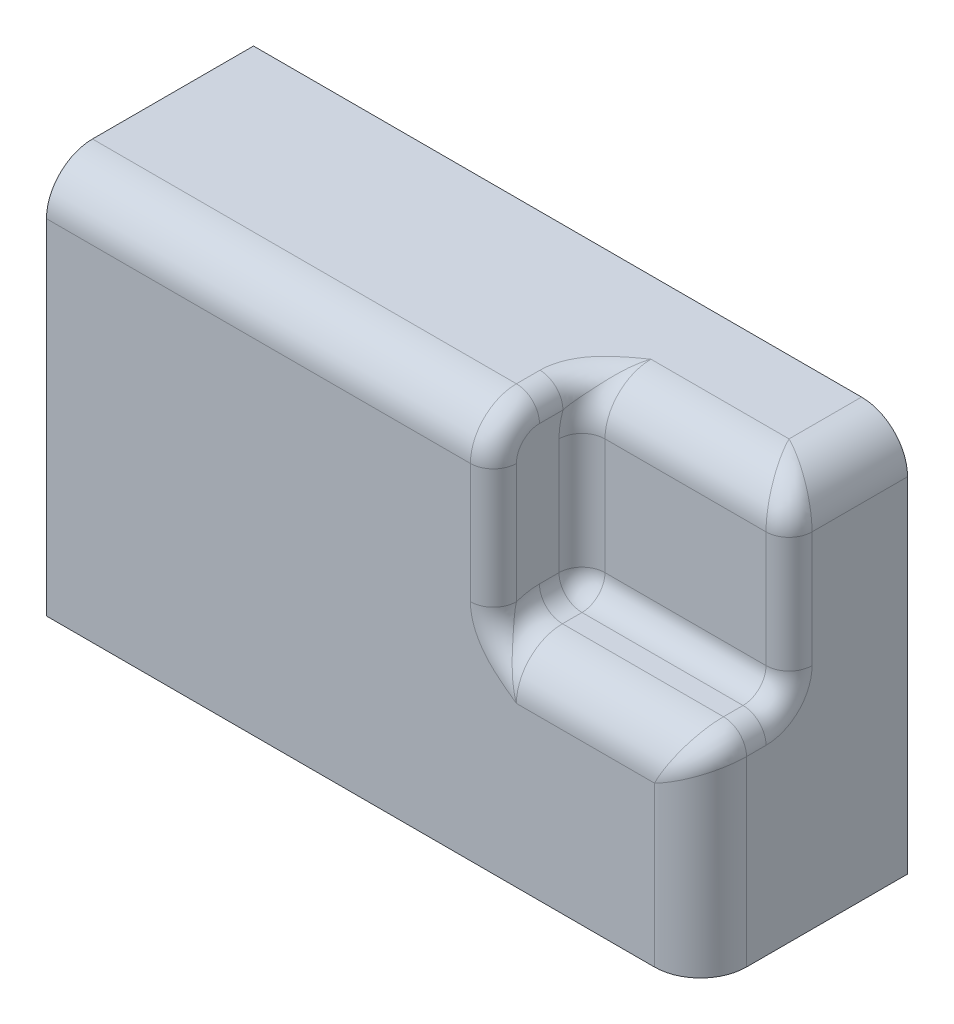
ISO-10303-21;
HEADER;
FILE_DESCRIPTION(('STEP AP214'),'2;1');
FILE_NAME('part.step','',(''),(''),'','','');
FILE_SCHEMA(('AUTOMOTIVE_DESIGN { 1 0 10303 214 1 1 1 1 }'));
ENDSEC;
DATA;
#1=APPLICATION_CONTEXT('core data for automotive mechanical design processes');
#2=APPLICATION_PROTOCOL_DEFINITION('international standard','automotive_design',2000,#1);
#3=PRODUCT_CONTEXT('',#1,'mechanical');
#4=PRODUCT('Part','Part','',(#3));
#5=PRODUCT_RELATED_PRODUCT_CATEGORY('part','',(#4));
#6=PRODUCT_DEFINITION_FORMATION('','',#4);
#7=PRODUCT_DEFINITION_CONTEXT('part definition',#1,'design');
#8=PRODUCT_DEFINITION('design','',#6,#7);
#9=PRODUCT_DEFINITION_SHAPE('','',#8);
#10=(LENGTH_UNIT() NAMED_UNIT(*) SI_UNIT(.MILLI.,.METRE.));
#11=(NAMED_UNIT(*) PLANE_ANGLE_UNIT() SI_UNIT($,.RADIAN.));
#12=(NAMED_UNIT(*) SI_UNIT($,.STERADIAN.) SOLID_ANGLE_UNIT());
#13=UNCERTAINTY_MEASURE_WITH_UNIT(LENGTH_MEASURE(1.E-05),#10,'distance_accuracy_value','');
#14=(GEOMETRIC_REPRESENTATION_CONTEXT(3) GLOBAL_UNCERTAINTY_ASSIGNED_CONTEXT((#13)) GLOBAL_UNIT_ASSIGNED_CONTEXT((#10,
#11,#12)) REPRESENTATION_CONTEXT('',''));
#15=CARTESIAN_POINT('',(0.,0.,0.));
#16=DIRECTION('',(0.,0.,1.));
#17=DIRECTION('',(1.,0.,0.));
#18=AXIS2_PLACEMENT_3D('',#15,#16,#17);
#19=CARTESIAN_POINT('',(69.6661337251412,25.2042665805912,15.6239445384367));
#20=DIRECTION('',(-1.,0.,0.));
#21=DIRECTION('',(0.,0.,1.));
#22=AXIS2_PLACEMENT_3D('',#19,#20,#21);
#23=TOROIDAL_SURFACE('',#22,5.08,2.54);
#24=CARTESIAN_POINT('',(69.6661337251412,20.1242665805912,15.6239445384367));
#25=DIRECTION('',(0.,0.,-1.));
#26=DIRECTION('',(-1.,0.,0.));
#27=AXIS2_PLACEMENT_3D('',#24,#25,#26);
#28=CIRCLE('',#27,2.54);
#29=CARTESIAN_POINT('',(69.6661337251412,22.6642665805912,15.6239445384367));
#30=VERTEX_POINT('',#29);
#31=CARTESIAN_POINT('',(72.2061337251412,20.1242665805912,15.6239445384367));
#32=VERTEX_POINT('',#31);
#33=EDGE_CURVE('E37',#30,#32,#28,.T.);
#34=ORIENTED_EDGE('',*,*,#33,.T.);
#35=CARTESIAN_POINT('',(72.2061337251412,25.2042665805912,15.6239445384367));
#36=DIRECTION('',(-1.,0.,0.));
#37=DIRECTION('',(0.,0.,1.));
#38=AXIS2_PLACEMENT_3D('',#35,#36,#37);
#39=CIRCLE('',#38,5.08);
#40=CARTESIAN_POINT('',(72.2061337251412,25.2042665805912,10.5439445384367));
#41=VERTEX_POINT('',#40);
#42=EDGE_CURVE('E129',#41,#32,#39,.T.);
#43=ORIENTED_EDGE('',*,*,#42,.F.);
#44=CARTESIAN_POINT('',(69.6661337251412,25.2042665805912,10.5439445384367));
#45=DIRECTION('',(0.,1.,0.));
#46=DIRECTION('',(0.,0.,1.));
#47=AXIS2_PLACEMENT_3D('',#44,#45,#46);
#48=CIRCLE('',#47,2.54);
#49=CARTESIAN_POINT('',(69.6661337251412,25.2042665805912,13.0839445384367));
#50=VERTEX_POINT('',#49);
#51=EDGE_CURVE('E130',#50,#41,#48,.T.);
#52=ORIENTED_EDGE('',*,*,#51,.F.);
#53=CARTESIAN_POINT('',(69.6661337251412,25.2042665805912,15.6239445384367));
#54=DIRECTION('',(-1.,0.,0.));
#55=DIRECTION('',(0.,0.,1.));
#56=AXIS2_PLACEMENT_3D('',#53,#54,#55);
#57=CIRCLE('',#56,2.54);
#58=EDGE_CURVE('E120',#30,#50,#57,.F.);
#59=ORIENTED_EDGE('',*,*,#58,.F.);
#60=EDGE_LOOP('',(#34,#43,#52,#59));
#61=FACE_BOUND('',#60,.T.);
#62=ADVANCED_FACE('F34',(#61),#23,.T.);
#63=CARTESIAN_POINT('',(49.5142506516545,40.2857519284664,16.2179611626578));
#64=CARTESIAN_POINT('',(49.766970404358,43.0703253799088,16.1247114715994));
#65=CARTESIAN_POINT('',(47.1423675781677,43.0703253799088,17.0931494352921));
#66=CARTESIAN_POINT('',(49.486113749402,40.3017080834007,16.1372760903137));
#67=CARTESIAN_POINT('',(49.7237671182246,43.0703253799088,16.0586318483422));
#68=CARTESIAN_POINT('',(47.0860937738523,43.0703253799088,16.9407074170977));
#69=CARTESIAN_POINT('',(49.4614887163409,40.3186402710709,16.0549357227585));
#70=CARTESIAN_POINT('',(49.682112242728,43.0703253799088,15.989429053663));
#71=CARTESIAN_POINT('',(47.0368437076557,43.0703253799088,16.7857049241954));
#72=CARTESIAN_POINT('',(49.4193154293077,40.3546663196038,15.8874596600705));
#73=CARTESIAN_POINT('',(49.6027508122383,43.0703253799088,15.8449545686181));
#74=CARTESIAN_POINT('',(46.9524971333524,43.0703253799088,16.4719665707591));
#75=CARTESIAN_POINT('',(49.4017639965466,40.373759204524,15.8023252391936));
#76=CARTESIAN_POINT('',(49.5650455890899,43.0703253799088,15.7697921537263));
#77=CARTESIAN_POINT('',(46.9173942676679,43.0703253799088,16.313232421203));
#78=CARTESIAN_POINT('',(49.3738309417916,40.4142354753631,15.6301060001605));
#79=CARTESIAN_POINT('',(49.4942415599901,43.0703253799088,15.613679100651));
#80=CARTESIAN_POINT('',(46.8615281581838,43.0703253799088,15.9940259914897));
#81=CARTESIAN_POINT('',(49.3634162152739,40.4356077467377,15.543032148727));
#82=CARTESIAN_POINT('',(49.4611175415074,43.0703253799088,15.5328790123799));
#83=CARTESIAN_POINT('',(46.8406987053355,43.0703253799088,15.8335652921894));
#84=CARTESIAN_POINT('',(49.3495650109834,40.4809483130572,15.3669679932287));
#85=CARTESIAN_POINT('',(49.3998416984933,43.0703253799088,15.3651911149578));
#86=CARTESIAN_POINT('',(46.8129962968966,43.0703253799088,15.5114746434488));
#87=CARTESIAN_POINT('',(49.3461290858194,40.5049168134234,15.2779775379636));
#88=CARTESIAN_POINT('',(49.3716730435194,43.0703253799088,15.2784349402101));
#89=CARTESIAN_POINT('',(46.8061244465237,43.0703253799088,15.3498446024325));
#90=CARTESIAN_POINT('',(49.3461429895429,40.5810645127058,15.00876898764));
#91=CARTESIAN_POINT('',(49.2958904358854,43.0703253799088,15.0105315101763));
#92=CARTESIAN_POINT('',(46.8061522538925,43.0703253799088,14.8652554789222));
#93=CARTESIAN_POINT('',(49.359872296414,40.6375462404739,14.8260482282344));
#94=CARTESIAN_POINT('',(49.255947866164,43.0703253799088,14.8197264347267));
#95=CARTESIAN_POINT('',(46.833610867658,43.0703253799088,14.542101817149));
#96=CARTESIAN_POINT('',(49.4131219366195,40.7641556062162,14.4554779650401));
#97=CARTESIAN_POINT('',(49.203146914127,43.0703253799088,14.4140010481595));
#98=CARTESIAN_POINT('',(46.940110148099,43.0703253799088,13.9043486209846));
#99=CARTESIAN_POINT('',(49.4526653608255,40.8342954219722,14.2676240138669));
#100=CARTESIAN_POINT('',(49.1898017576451,43.0703253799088,14.2004364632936));
#101=CARTESIAN_POINT('',(47.0191969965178,43.0703253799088,13.5897570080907));
#102=CARTESIAN_POINT('',(49.5303901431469,40.9528605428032,13.9772196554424));
#103=CARTESIAN_POINT('',(49.1936797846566,43.0703253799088,13.8568052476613));
#104=CARTESIAN_POINT('',(47.1746465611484,43.0703253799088,13.1230728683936));
#105=CARTESIAN_POINT('',(49.5601907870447,40.9956436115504,13.876807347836));
#106=CARTESIAN_POINT('',(49.1991570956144,43.0703253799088,13.7370654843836));
#107=CARTESIAN_POINT('',(47.2342478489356,43.0703253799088,12.965172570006));
#108=CARTESIAN_POINT('',(49.6256459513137,41.0856723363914,13.6737791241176));
#109=CARTESIAN_POINT('',(49.2192038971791,43.0703253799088,13.4922404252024));
#110=CARTESIAN_POINT('',(47.3651581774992,43.0703253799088,12.6542754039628));
#111=CARTESIAN_POINT('',(49.661300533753,41.1329180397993,13.5711631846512));
#112=CARTESIAN_POINT('',(49.2336300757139,43.0703253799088,13.3673697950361));
#113=CARTESIAN_POINT('',(47.4364673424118,43.0703253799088,12.5012785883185));
#114=CARTESIAN_POINT('',(49.7379792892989,41.2319548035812,13.3630740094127));
#115=CARTESIAN_POINT('',(49.2720017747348,43.0703253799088,13.1128443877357));
#116=CARTESIAN_POINT('',(47.5898248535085,43.0703253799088,12.200833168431));
#117=CARTESIAN_POINT('',(49.7790022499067,41.283744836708,13.2576014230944));
#118=CARTESIAN_POINT('',(49.2957795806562,43.0703253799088,12.9833980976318));
#119=CARTESIAN_POINT('',(47.6718707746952,43.0703253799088,12.0533833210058));
#120=CARTESIAN_POINT('',(49.8659247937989,41.3917812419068,13.0428164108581));
#121=CARTESIAN_POINT('',(49.3531262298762,43.0703253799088,12.7202967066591));
#122=CARTESIAN_POINT('',(47.8457158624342,43.0703253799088,11.7643668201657));
#123=CARTESIAN_POINT('',(49.9118248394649,41.4480280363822,12.933503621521));
#124=CARTESIAN_POINT('',(49.3865140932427,43.0703253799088,12.5868292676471));
#125=CARTESIAN_POINT('',(47.93751595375,43.0703253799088,11.6228007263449));
#126=CARTESIAN_POINT('',(50.0390254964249,41.6023508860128,12.6377070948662));
#127=CARTESIAN_POINT('',(49.4874648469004,43.0703253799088,12.2308693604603));
#128=CARTESIAN_POINT('',(48.191917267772,43.0703253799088,11.2564135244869));
#129=CARTESIAN_POINT('',(50.124073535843,41.7040191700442,12.4468991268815));
#130=CARTESIAN_POINT('',(49.5633874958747,43.0703253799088,12.0038989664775));
#131=CARTESIAN_POINT('',(48.36201334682,43.0703253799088,11.0367477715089));
#132=CARTESIAN_POINT('',(50.2588100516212,41.862257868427,12.1458312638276));
#133=CARTESIAN_POINT('',(49.6980827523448,43.0703253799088,11.6558753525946));
#134=CARTESIAN_POINT('',(48.631486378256,43.0703253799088,10.7195817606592));
#135=CARTESIAN_POINT('',(50.3049383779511,41.9159852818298,12.0429503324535));
#136=CARTESIAN_POINT('',(49.7458622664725,43.0703253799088,11.5398236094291));
#137=CARTESIAN_POINT('',(48.7237430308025,43.0703253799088,10.6158718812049));
#138=CARTESIAN_POINT('',(50.3993195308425,42.0245317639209,11.8313800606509));
#139=CARTESIAN_POINT('',(49.8477005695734,43.0703253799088,11.3063966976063));
#140=CARTESIAN_POINT('',(48.9125053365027,43.0703253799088,10.4123932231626));
#141=CARTESIAN_POINT('',(50.4475721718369,42.079350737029,11.7226912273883));
#142=CARTESIAN_POINT('',(49.9016744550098,43.0703253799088,11.1890392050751));
#143=CARTESIAN_POINT('',(49.0090106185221,43.0703253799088,10.3126241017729));
#144=CARTESIAN_POINT('',(50.5460331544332,42.1891651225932,11.4985262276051));
#145=CARTESIAN_POINT('',(50.0156786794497,43.0703253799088,10.9530976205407));
#146=CARTESIAN_POINT('',(49.2059325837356,43.0703253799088,10.1166337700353));
#147=CARTESIAN_POINT('',(50.5962452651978,42.2441606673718,11.3830367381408));
#148=CARTESIAN_POINT('',(50.0756586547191,43.0703253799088,10.8344922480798));
#149=CARTESIAN_POINT('',(49.3063568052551,43.0703253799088,10.0204201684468));
#150=CARTESIAN_POINT('',(50.6982783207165,42.3529116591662,11.1448426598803));
#151=CARTESIAN_POINT('',(50.2011373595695,43.0703253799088,10.5965881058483));
#152=CARTESIAN_POINT('',(49.5104229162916,43.0703253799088,9.83147196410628));
#153=CARTESIAN_POINT('',(50.7500992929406,42.4066670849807,11.0221379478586));
#154=CARTESIAN_POINT('',(50.266600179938,43.0703253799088,10.4772357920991));
#155=CARTESIAN_POINT('',(49.6140648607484,43.0703253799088,9.73873742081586));
#156=CARTESIAN_POINT('',(50.8550902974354,42.5113783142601,10.769169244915));
#157=CARTESIAN_POINT('',(50.402478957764,43.0703253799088,10.2381368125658));
#158=CARTESIAN_POINT('',(49.8240468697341,43.0703253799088,9.55643673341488));
#159=CARTESIAN_POINT('',(50.9082600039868,42.5623347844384,10.6389070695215));
#160=CARTESIAN_POINT('',(50.472891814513,43.0703253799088,10.1182972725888));
#161=CARTESIAN_POINT('',(49.9303862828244,43.0703253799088,9.46686983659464));
#162=CARTESIAN_POINT('',(51.0157255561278,42.6597315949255,10.3707604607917));
#163=CARTESIAN_POINT('',(50.6180462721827,43.0703253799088,9.87842023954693));
#164=CARTESIAN_POINT('',(50.1453173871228,43.0703253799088,9.29049351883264));
#165=CARTESIAN_POINT('',(51.070021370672,42.7061720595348,10.2328762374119));
#166=CARTESIAN_POINT('',(50.6928248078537,43.0703253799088,9.75824895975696));
#167=CARTESIAN_POINT('',(50.2539090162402,43.0703253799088,9.20368402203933));
#168=CARTESIAN_POINT('',(51.1555088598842,42.7737502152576,10.0119394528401));
#169=CARTESIAN_POINT('',(50.8126416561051,43.0703253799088,9.57021770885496));
#170=CARTESIAN_POINT('',(50.4248839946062,43.0703253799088,9.06994523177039));
#171=CARTESIAN_POINT('',(51.1863912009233,42.7970532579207,9.93135691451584));
#172=CARTESIAN_POINT('',(50.8562269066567,43.0703253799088,9.50269456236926));
#173=CARTESIAN_POINT('',(50.4866486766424,43.0703253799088,9.02222095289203));
#174=CARTESIAN_POINT('',(51.2484002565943,42.8413507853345,9.7680703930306));
#175=CARTESIAN_POINT('',(50.9444017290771,43.0703253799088,9.36765029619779));
#176=CARTESIAN_POINT('',(50.6106667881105,43.0703253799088,8.92742555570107));
#177=CARTESIAN_POINT('',(51.2795269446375,42.8623455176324,9.68536663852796));
#178=CARTESIAN_POINT('',(50.9890089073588,43.0703253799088,9.30009501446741));
#179=CARTESIAN_POINT('',(50.6729201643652,43.0703253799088,8.88035436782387));
#180=CARTESIAN_POINT('',(51.3731491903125,42.9213657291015,9.43451834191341));
#181=CARTESIAN_POINT('',(51.1237693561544,43.0703253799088,9.09800570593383));
#182=CARTESIAN_POINT('',(50.8601646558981,43.0703253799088,8.74009554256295));
#183=CARTESIAN_POINT('',(51.43595975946,42.9554861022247,9.2634482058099));
#184=CARTESIAN_POINT('',(51.2156338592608,43.0703253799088,8.96285326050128));
#185=CARTESIAN_POINT('',(50.9857857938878,43.0703253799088,8.6477493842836));
#186=CARTESIAN_POINT('',(51.5622122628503,43.0112512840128,8.91531161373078));
#187=CARTESIAN_POINT('',(51.401711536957,43.0703253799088,8.69268211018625));
#188=CARTESIAN_POINT('',(51.2382908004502,43.0703253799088,8.46447853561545));
#189=CARTESIAN_POINT('',(51.6256548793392,43.032880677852,8.73823803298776));
#190=CARTESIAN_POINT('',(51.4961523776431,43.0703253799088,8.55731747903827));
#191=CARTESIAN_POINT('',(51.3651760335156,43.0703253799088,8.37355573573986));
#192=CARTESIAN_POINT('',(51.752835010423,43.0621897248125,8.38092855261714));
#193=CARTESIAN_POINT('',(51.6860608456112,43.0703253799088,8.28691983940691));
#194=CARTESIAN_POINT('',(51.6195362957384,43.0703253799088,8.19247606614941));
#195=CARTESIAN_POINT('',(51.8165725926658,43.0698660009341,8.2006918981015));
#196=CARTESIAN_POINT('',(51.7817883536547,43.0703253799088,8.15151205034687));
#197=CARTESIAN_POINT('',(51.7470114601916,43.0703253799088,8.1023193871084));
#198=CARTESIAN_POINT('',(51.8822540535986,43.0703187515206,8.01491791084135));
#199=CARTESIAN_POINT('',(51.880314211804,43.0703253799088,8.01217457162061));
#200=CARTESIAN_POINT('',(51.878374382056,43.0703253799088,8.00943122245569));
#201=CARTESIAN_POINT('',(51.8841938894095,43.0703254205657,8.00943122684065));
#202=CARTESIAN_POINT('',(51.8832239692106,43.0703253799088,8.00805955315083));
#203=CARTESIAN_POINT('',(51.8822540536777,43.0703253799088,8.00668788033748));
#204=CARTESIAN_POINT('',(51.8861337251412,43.0703253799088,8.00394453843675));
#205=CARTESIAN_POINT('',(51.8861337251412,43.0703253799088,8.00394453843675));
#206=CARTESIAN_POINT('',(51.8861337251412,43.0703253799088,8.00394453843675));
#207=(BOUNDED_SURFACE() B_SPLINE_SURFACE(3,2,((#63,#64,#65),(#66,#67,#68),(#69,#70,#71),(#72,
#73,#74),(#75,#76,#77),(#78,#79,#80),(#81,#82,#83),(#84,#85,#86),(#87,#88,#89),(#90,#91,#92),
(#93,#94,#95),(#96,#97,#98),(#99,#100,#101),(#102,#103,#104),(#105,#106,#107),(#108,#109,#110),
(#111,#112,#113),(#114,#115,#116),(#117,#118,#119),(#120,#121,#122),(#123,#124,#125),(#126,#127,
#128),(#129,#130,#131),(#132,#133,#134),(#135,#136,#137),(#138,#139,#140),(#141,#142,#143),
(#144,#145,#146),(#147,#148,#149),(#150,#151,#152),(#153,#154,#155),(#156,#157,#158),(#159,#160,
#161),(#162,#163,#164),(#165,#166,#167),(#168,#169,#170),(#171,#172,#173),(#174,#175,#176),
(#177,#178,#179),(#180,#181,#182),(#183,#184,#185),(#186,#187,#188),(#189,#190,#191),(#192,#193,
#194),(#195,#196,#197),(#198,#199,#200),(#201,#202,#203),(#204,#205,#206)),.UNSPECIFIED.,.F.,
.F.,.F.) B_SPLINE_SURFACE_WITH_KNOTS((4,2,2,2,2,2,2,2,2,2,2,2,2,2,2,2,2,2,2,2,2,2,2,4),(3,3),
(0.,0.487275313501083,0.974331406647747,1.45911264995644,1.94393227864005,2.91208321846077,
3.8811013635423,4.38701547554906,4.89293495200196,5.39874035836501,5.90459376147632,
6.73651786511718,7.15284985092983,7.56914554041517,7.9862858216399,8.40343322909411,
8.82048083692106,9.23751696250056,9.4716763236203,9.70581054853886,10.1735255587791,
10.6418165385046,11.1102208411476,11.1244756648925),(0.,1.),
.UNSPECIFIED.) GEOMETRIC_REPRESENTATION_ITEM() RATIONAL_B_SPLINE_SURFACE(((1.,0.672202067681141,
1.),(1.,0.674538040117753,1.),(1.,0.677005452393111,1.),(1.,0.682223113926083,1.),(1.,
0.684973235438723,1.),(1.,0.690764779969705,1.),(1.,0.69380478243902,1.),(1.,0.700207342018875,
1.),(1.,0.703569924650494,1.),(1.,0.71416963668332,1.),(1.,0.721927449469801,1.),(1.,
0.738987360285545,1.),(1.,0.748290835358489,1.),(1.,0.763677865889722,1.),(1.,0.769175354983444,
1.),(1.,0.780610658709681,1.),(1.,0.786548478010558,1.),(1.,0.798845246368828,1.),(1.,
0.80520410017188,1.),(1.,0.818303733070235,1.),(1.,0.825044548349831,1.),(1.,0.843300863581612,
1.),(1.,0.855093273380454,1.),(1.,0.873056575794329,1.),(1.,0.879092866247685,1.),(1.,
0.891162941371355,1.),(1.,0.897196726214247,1.),(1.,0.909163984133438,1.),(1.,0.915097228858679,
1.),(1.,0.926720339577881,1.),(1.,0.932410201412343,1.),(1.,0.943398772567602,1.),(1.,
0.948697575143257,1.),(1.,0.958749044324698,1.),(1.,0.963501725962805,1.),(1.,0.970373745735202,
1.),(1.,0.972733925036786,1.),(1.,0.977205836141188,1.),(1.,0.979317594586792,1.),(1.,
0.985237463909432,1.),(1.,0.988636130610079,1.),(1.,0.994172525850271,1.),(1.,0.996308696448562,
1.),(1.,0.999200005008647,1.),(1.,0.999954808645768,1.),(1.,0.999999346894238,1.),(1.,
1.00000000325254,1.),(1.,1.,1.))) REPRESENTATION_ITEM('') SURFACE());
#208=CARTESIAN_POINT('',(46.8061337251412,40.5303253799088,15.1881494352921));
#209=DIRECTION('',(0.,0.,-1.));
#210=DIRECTION('',(-1.,0.,0.));
#211=AXIS2_PLACEMENT_3D('',#208,#209,#210);
#212=CIRCLE('',#211,2.54);
#213=CARTESIAN_POINT('',(46.8061337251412,43.0703253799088,15.1881494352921));
#214=VERTEX_POINT('',#213);
#215=CARTESIAN_POINT('',(49.3461337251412,40.5303253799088,15.1881494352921));
#216=VERTEX_POINT('',#215);
#217=EDGE_CURVE('E183',#214,#216,#212,.T.);
#218=ORIENTED_EDGE('',*,*,#217,.T.);
#219=CARTESIAN_POINT('',(49.5142506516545,40.2857519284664,16.2179611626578));
#220=CARTESIAN_POINT('',(49.486113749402,40.3017080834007,16.1372760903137));
#221=CARTESIAN_POINT('',(49.4614887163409,40.3186402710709,16.0549357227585));
#222=CARTESIAN_POINT('',(49.4193154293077,40.3546663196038,15.8874596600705));
#223=CARTESIAN_POINT('',(49.4017639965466,40.373759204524,15.8023252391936));
#224=CARTESIAN_POINT('',(49.3738309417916,40.4142354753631,15.6301060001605));
#225=CARTESIAN_POINT('',(49.3634162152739,40.4356077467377,15.543032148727));
#226=CARTESIAN_POINT('',(49.3495650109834,40.4809483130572,15.3669679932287));
#227=CARTESIAN_POINT('',(49.3461290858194,40.5049168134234,15.2779775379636));
#228=CARTESIAN_POINT('',(49.3461429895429,40.5810645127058,15.00876898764));
#229=CARTESIAN_POINT('',(49.359872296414,40.6375462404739,14.8260482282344));
#230=CARTESIAN_POINT('',(49.4131219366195,40.7641556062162,14.4554779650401));
#231=CARTESIAN_POINT('',(49.4526653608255,40.8342954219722,14.2676240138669));
#232=CARTESIAN_POINT('',(49.5303901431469,40.9528605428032,13.9772196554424));
#233=CARTESIAN_POINT('',(49.5601907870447,40.9956436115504,13.876807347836));
#234=CARTESIAN_POINT('',(49.6256459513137,41.0856723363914,13.6737791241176));
#235=CARTESIAN_POINT('',(49.661300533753,41.1329180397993,13.5711631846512));
#236=CARTESIAN_POINT('',(49.7379792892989,41.2319548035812,13.3630740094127));
#237=CARTESIAN_POINT('',(49.7790022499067,41.283744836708,13.2576014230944));
#238=CARTESIAN_POINT('',(49.8659247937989,41.3917812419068,13.0428164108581));
#239=CARTESIAN_POINT('',(49.9118248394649,41.4480280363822,12.933503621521));
#240=CARTESIAN_POINT('',(50.0390254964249,41.6023508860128,12.6377070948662));
#241=CARTESIAN_POINT('',(50.124073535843,41.7040191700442,12.4468991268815));
#242=CARTESIAN_POINT('',(50.2588100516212,41.862257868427,12.1458312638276));
#243=CARTESIAN_POINT('',(50.3049383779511,41.9159852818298,12.0429503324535));
#244=CARTESIAN_POINT('',(50.3993195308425,42.0245317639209,11.8313800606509));
#245=CARTESIAN_POINT('',(50.4475721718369,42.079350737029,11.7226912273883));
#246=CARTESIAN_POINT('',(50.5460331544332,42.1891651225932,11.4985262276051));
#247=CARTESIAN_POINT('',(50.5962452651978,42.2441606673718,11.3830367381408));
#248=CARTESIAN_POINT('',(50.6982783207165,42.3529116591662,11.1448426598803));
#249=CARTESIAN_POINT('',(50.7500992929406,42.4066670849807,11.0221379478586));
#250=CARTESIAN_POINT('',(50.8550902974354,42.5113783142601,10.769169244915));
#251=CARTESIAN_POINT('',(50.9082600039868,42.5623347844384,10.6389070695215));
#252=CARTESIAN_POINT('',(51.0157255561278,42.6597315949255,10.3707604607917));
#253=CARTESIAN_POINT('',(51.070021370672,42.7061720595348,10.2328762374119));
#254=CARTESIAN_POINT('',(51.1555088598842,42.7737502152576,10.0119394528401));
#255=CARTESIAN_POINT('',(51.1863912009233,42.7970532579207,9.93135691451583));
#256=CARTESIAN_POINT('',(51.2484002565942,42.8413507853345,9.7680703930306));
#257=CARTESIAN_POINT('',(51.2795269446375,42.8623455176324,9.68536663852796));
#258=CARTESIAN_POINT('',(51.3731491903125,42.9213657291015,9.43451834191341));
#259=CARTESIAN_POINT('',(51.43595975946,42.9554861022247,9.2634482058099));
#260=CARTESIAN_POINT('',(51.5622122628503,43.0112512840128,8.91531161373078));
#261=CARTESIAN_POINT('',(51.6256548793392,43.032880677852,8.73823803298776));
#262=CARTESIAN_POINT('',(51.752835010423,43.0621897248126,8.38092855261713));
#263=CARTESIAN_POINT('',(51.8165725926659,43.0698660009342,8.20069189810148));
#264=CARTESIAN_POINT('',(51.8822540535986,43.0703187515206,8.01491791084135));
#265=CARTESIAN_POINT('',(51.8841938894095,43.0703254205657,8.00943122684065));
#266=CARTESIAN_POINT('',(51.8861337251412,43.0703253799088,8.00394453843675));
#267=B_SPLINE_CURVE_WITH_KNOTS('',3,(#219,#220,#221,#222,#223,#224,#225,#226,#227,#228,#229,
#230,#231,#232,#233,#234,#235,#236,#237,#238,#239,#240,#241,#242,#243,#244,#245,#246,#247,#248,
#249,#250,#251,#252,#253,#254,#255,#256,#257,#258,#259,#260,#261,#262,#263,#264,#265,#266),
.UNSPECIFIED.,.F.,.F.,(4,2,2,2,2,2,2,2,2,2,2,2,2,2,2,2,2,2,2,2,2,2,2,4),(0.,0.487275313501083,
0.974331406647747,1.45911264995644,1.94393227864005,2.91208321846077,3.8811013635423,
4.38701547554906,4.89293495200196,5.39874035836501,5.90459376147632,6.73651786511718,
7.15284985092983,7.56914554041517,7.9862858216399,8.40343322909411,8.82048083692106,
9.23751696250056,9.4716763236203,9.70581054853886,10.1735255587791,10.6418165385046,
11.1102208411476,11.1244756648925),.UNSPECIFIED.);
#268=CARTESIAN_POINT('',(51.8861337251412,43.0703253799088,8.00394453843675));
#269=VERTEX_POINT('',#268);
#270=EDGE_CURVE('E166',#269,#216,#267,.F.);
#271=ORIENTED_EDGE('',*,*,#270,.F.);
#272=CARTESIAN_POINT('',(47.1423675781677,43.0703253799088,17.0931494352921));
#273=CARTESIAN_POINT('',(47.0860937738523,43.0703253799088,16.9407074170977));
#274=CARTESIAN_POINT('',(47.0368437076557,43.0703253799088,16.7857049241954));
#275=CARTESIAN_POINT('',(46.9524971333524,43.0703253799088,16.4719665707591));
#276=CARTESIAN_POINT('',(46.9173942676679,43.0703253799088,16.313232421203));
#277=CARTESIAN_POINT('',(46.8615281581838,43.0703253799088,15.9940259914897));
#278=CARTESIAN_POINT('',(46.8406987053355,43.0703253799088,15.8335652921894));
#279=CARTESIAN_POINT('',(46.8129962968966,43.0703253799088,15.5114746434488));
#280=CARTESIAN_POINT('',(46.8061244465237,43.0703253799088,15.3498446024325));
#281=CARTESIAN_POINT('',(46.8061522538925,43.0703253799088,14.8652554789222));
#282=CARTESIAN_POINT('',(46.833610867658,43.0703253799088,14.542101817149));
#283=CARTESIAN_POINT('',(46.940110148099,43.0703253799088,13.9043486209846));
#284=CARTESIAN_POINT('',(47.0191969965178,43.0703253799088,13.5897570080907));
#285=CARTESIAN_POINT('',(47.1746465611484,43.0703253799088,13.1230728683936));
#286=CARTESIAN_POINT('',(47.2342478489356,43.0703253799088,12.965172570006));
#287=CARTESIAN_POINT('',(47.3651581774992,43.0703253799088,12.6542754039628));
#288=CARTESIAN_POINT('',(47.4364673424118,43.0703253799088,12.5012785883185));
#289=CARTESIAN_POINT('',(47.5898248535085,43.0703253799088,12.200833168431));
#290=CARTESIAN_POINT('',(47.6718707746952,43.0703253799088,12.0533833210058));
#291=CARTESIAN_POINT('',(47.8457158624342,43.0703253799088,11.7643668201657));
#292=CARTESIAN_POINT('',(47.93751595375,43.0703253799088,11.6228007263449));
#293=CARTESIAN_POINT('',(48.191917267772,43.0703253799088,11.2564135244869));
#294=CARTESIAN_POINT('',(48.36201334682,43.0703253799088,11.0367477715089));
#295=CARTESIAN_POINT('',(48.631486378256,43.0703253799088,10.7195817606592));
#296=CARTESIAN_POINT('',(48.7237430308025,43.0703253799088,10.6158718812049));
#297=CARTESIAN_POINT('',(48.9125053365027,43.0703253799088,10.4123932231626));
#298=CARTESIAN_POINT('',(49.0090106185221,43.0703253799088,10.3126241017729));
#299=CARTESIAN_POINT('',(49.2059325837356,43.0703253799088,10.1166337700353));
#300=CARTESIAN_POINT('',(49.3063568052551,43.0703253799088,10.0204201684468));
#301=CARTESIAN_POINT('',(49.5104229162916,43.0703253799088,9.83147196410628));
#302=CARTESIAN_POINT('',(49.6140648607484,43.0703253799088,9.73873742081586));
#303=CARTESIAN_POINT('',(49.8240468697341,43.0703253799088,9.55643673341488));
#304=CARTESIAN_POINT('',(49.9303862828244,43.0703253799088,9.46686983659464));
#305=CARTESIAN_POINT('',(50.1453173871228,43.0703253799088,9.29049351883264));
#306=CARTESIAN_POINT('',(50.2539090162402,43.0703253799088,9.20368402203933));
#307=CARTESIAN_POINT('',(50.4248839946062,43.0703253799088,9.06994523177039));
#308=CARTESIAN_POINT('',(50.4866486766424,43.0703253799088,9.02222095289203));
#309=CARTESIAN_POINT('',(50.6106667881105,43.0703253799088,8.92742555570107));
#310=CARTESIAN_POINT('',(50.6729201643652,43.0703253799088,8.88035436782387));
#311=CARTESIAN_POINT('',(50.8601646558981,43.0703253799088,8.74009554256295));
#312=CARTESIAN_POINT('',(50.9857857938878,43.0703253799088,8.6477493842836));
#313=CARTESIAN_POINT('',(51.2382908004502,43.0703253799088,8.46447853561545));
#314=CARTESIAN_POINT('',(51.3651760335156,43.0703253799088,8.37355573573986));
#315=CARTESIAN_POINT('',(51.6195362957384,43.0703253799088,8.19247606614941));
#316=CARTESIAN_POINT('',(51.7470114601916,43.0703253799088,8.10231938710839));
#317=CARTESIAN_POINT('',(51.878374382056,43.0703253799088,8.0094312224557));
#318=CARTESIAN_POINT('',(51.8822540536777,43.0703253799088,8.00668788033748));
#319=CARTESIAN_POINT('',(51.8861337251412,43.0703253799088,8.00394453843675));
#320=B_SPLINE_CURVE_WITH_KNOTS('',3,(#272,#273,#274,#275,#276,#277,#278,#279,#280,#281,#282,
#283,#284,#285,#286,#287,#288,#289,#290,#291,#292,#293,#294,#295,#296,#297,#298,#299,#300,#301,
#302,#303,#304,#305,#306,#307,#308,#309,#310,#311,#312,#313,#314,#315,#316,#317,#318,#319),
.UNSPECIFIED.,.F.,.F.,(4,2,2,2,2,2,2,2,2,2,2,2,2,2,2,2,2,2,2,2,2,2,2,4),(0.,0.487275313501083,
0.974331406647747,1.45911264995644,1.94393227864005,2.91208321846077,3.8811013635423,
4.38701547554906,4.89293495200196,5.39874035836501,5.90459376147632,6.73651786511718,
7.15284985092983,7.56914554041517,7.9862858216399,8.40343322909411,8.82048083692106,
9.23751696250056,9.4716763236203,9.70581054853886,10.1735255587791,10.6418165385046,
11.1102208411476,11.1244756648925),.UNSPECIFIED.);
#321=EDGE_CURVE('E180',#214,#269,#320,.T.);
#322=ORIENTED_EDGE('',*,*,#321,.F.);
#323=EDGE_LOOP('',(#218,#271,#322));
#324=FACE_BOUND('',#323,.T.);
#325=ADVANCED_FACE('F209',(#324),#207,.T.);
#326=CARTESIAN_POINT('',(51.8861337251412,37.9903253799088,8.00394453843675));
#327=DIRECTION('',(1.,0.,0.));
#328=DIRECTION('',(0.,0.,-1.));
#329=AXIS2_PLACEMENT_3D('',#326,#327,#328);
#330=TOROIDAL_SURFACE('',#329,7.62,2.54);
#331=CARTESIAN_POINT('',(51.8861337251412,37.9903253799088,8.00394453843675));
#332=DIRECTION('',(1.,0.,0.));
#333=DIRECTION('',(0.,0.,-1.));
#334=AXIS2_PLACEMENT_3D('',#331,#332,#333);
#335=CIRCLE('',#334,5.08);
#336=CARTESIAN_POINT('',(51.8861337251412,37.9903253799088,13.0839445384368));
#337=VERTEX_POINT('',#336);
#338=EDGE_CURVE('E176',#269,#337,#335,.T.);
#339=ORIENTED_EDGE('',*,*,#338,.F.);
#340=ORIENTED_EDGE('',*,*,#270,.T.);
#341=CARTESIAN_POINT('',(49.3461337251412,37.9903253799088,8.00394453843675));
#342=DIRECTION('',(1.,0.,0.));
#343=DIRECTION('',(0.,0.,-1.));
#344=AXIS2_PLACEMENT_3D('',#341,#342,#343);
#345=CIRCLE('',#344,7.62);
#346=CARTESIAN_POINT('',(49.3461337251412,37.9903253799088,15.6239445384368));
#347=VERTEX_POINT('',#346);
#348=EDGE_CURVE('E173',#347,#216,#345,.F.);
#349=ORIENTED_EDGE('',*,*,#348,.F.);
#350=CARTESIAN_POINT('',(51.8861337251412,37.9903253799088,15.6239445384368));
#351=DIRECTION('',(0.,-1.,0.));
#352=DIRECTION('',(0.,0.,-1.));
#353=AXIS2_PLACEMENT_3D('',#350,#351,#352);
#354=CIRCLE('',#353,2.54);
#355=EDGE_CURVE('E177',#347,#337,#354,.T.);
#356=ORIENTED_EDGE('',*,*,#355,.T.);
#357=EDGE_LOOP('',(#339,#340,#349,#356));
#358=FACE_BOUND('',#357,.T.);
#359=ADVANCED_FACE('F205',(#358),#330,.F.);
#360=CARTESIAN_POINT('',(51.8861337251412,25.2042665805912,15.6239445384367));
#361=DIRECTION('',(0.,0.,1.));
#362=DIRECTION('',(1.,0.,0.));
#363=AXIS2_PLACEMENT_3D('',#360,#361,#362);
#364=SPHERICAL_SURFACE('',#363,2.54);
#365=CARTESIAN_POINT('',(51.8861337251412,25.2042665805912,15.6239445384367));
#366=DIRECTION('',(0.,1.,0.));
#367=DIRECTION('',(0.,0.,1.));
#368=AXIS2_PLACEMENT_3D('',#365,#366,#367);
#369=CIRCLE('',#368,2.54);
#370=CARTESIAN_POINT('',(51.8861337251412,25.2042665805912,13.0839445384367));
#371=VERTEX_POINT('',#370);
#372=CARTESIAN_POINT('',(49.3461337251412,25.2042665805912,15.6239445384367));
#373=VERTEX_POINT('',#372);
#374=EDGE_CURVE('E165',#371,#373,#369,.T.);
#375=ORIENTED_EDGE('',*,*,#374,.T.);
#376=CARTESIAN_POINT('',(51.8861337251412,25.2042665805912,15.6239445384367));
#377=DIRECTION('',(0.,0.,1.));
#378=DIRECTION('',(1.,0.,0.));
#379=AXIS2_PLACEMENT_3D('',#376,#377,#378);
#380=CIRCLE('',#379,2.54);
#381=CARTESIAN_POINT('',(51.8861337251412,22.6642665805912,15.6239445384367));
#382=VERTEX_POINT('',#381);
#383=EDGE_CURVE('E169',#373,#382,#380,.T.);
#384=ORIENTED_EDGE('',*,*,#383,.T.);
#385=CARTESIAN_POINT('',(51.8861337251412,25.2042665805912,15.6239445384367));
#386=DIRECTION('',(1.,0.,0.));
#387=DIRECTION('',(0.,0.,-1.));
#388=AXIS2_PLACEMENT_3D('',#385,#386,#387);
#389=CIRCLE('',#388,2.54);
#390=EDGE_CURVE('E123',#371,#382,#389,.F.);
#391=ORIENTED_EDGE('',*,*,#390,.F.);
#392=EDGE_LOOP('',(#375,#384,#391));
#393=FACE_BOUND('',#392,.T.);
#394=ADVANCED_FACE('F519',(#393),#364,.F.);
#395=CARTESIAN_POINT('',(51.8861337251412,25.2042665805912,0.));
#396=DIRECTION('',(0.,0.,-1.));
#397=DIRECTION('',(-1.,0.,0.));
#398=AXIS2_PLACEMENT_3D('',#395,#396,#397);
#399=CYLINDRICAL_SURFACE('',#398,2.54);
#400=DIRECTION('',(0.,0.,-1.));
#401=VECTOR('',#400,1.);
#402=CARTESIAN_POINT('',(49.3461337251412,25.2042665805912,0.));
#403=LINE('',#402,#401);
#404=CARTESIAN_POINT('',(49.3461337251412,25.2042665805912,17.78));
#405=VERTEX_POINT('',#404);
#406=EDGE_CURVE('E160',#405,#373,#403,.T.);
#407=ORIENTED_EDGE('',*,*,#406,.F.);
#408=CARTESIAN_POINT('',(51.8861337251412,25.2042665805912,17.78));
#409=DIRECTION('',(0.,0.,-1.));
#410=DIRECTION('',(-1.,0.,0.));
#411=AXIS2_PLACEMENT_3D('',#408,#409,#410);
#412=CIRCLE('',#411,2.54);
#413=CARTESIAN_POINT('',(51.8861337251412,22.6642665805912,17.78));
#414=VERTEX_POINT('',#413);
#415=EDGE_CURVE('E135',#414,#405,#412,.T.);
#416=ORIENTED_EDGE('',*,*,#415,.F.);
#417=DIRECTION('',(0.,0.,-1.));
#418=VECTOR('',#417,1.);
#419=CARTESIAN_POINT('',(51.8861337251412,22.6642665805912,22.86));
#420=LINE('',#419,#418);
#421=EDGE_CURVE('E43',#382,#414,#420,.F.);
#422=ORIENTED_EDGE('',*,*,#421,.F.);
#423=ORIENTED_EDGE('',*,*,#383,.F.);
#424=EDGE_LOOP('',(#407,#416,#422,#423));
#425=FACE_BOUND('',#424,.T.);
#426=ADVANCED_FACE('F297',(#425),#399,.F.);
#427=CARTESIAN_POINT('',(46.8061337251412,37.9903253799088,17.78));
#428=DIRECTION('',(1.,0.,0.));
#429=DIRECTION('',(0.,0.,-1.));
#430=AXIS2_PLACEMENT_3D('',#427,#428,#429);
#431=DEGENERATE_TOROIDAL_SURFACE('',#430,2.54,2.54,.T.);
#432=CARTESIAN_POINT('',(46.8061337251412,37.9903253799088,20.32));
#433=DIRECTION('',(0.,1.,0.));
#434=DIRECTION('',(0.,0.,1.));
#435=AXIS2_PLACEMENT_3D('',#432,#433,#434);
#436=CIRCLE('',#435,2.54);
#437=CARTESIAN_POINT('',(46.8061337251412,37.9903253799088,22.86));
#438=VERTEX_POINT('',#437);
#439=CARTESIAN_POINT('',(49.3461337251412,37.9903253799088,20.32));
#440=VERTEX_POINT('',#439);
#441=EDGE_CURVE('E302',#438,#440,#436,.T.);
#442=ORIENTED_EDGE('',*,*,#441,.T.);
#443=CARTESIAN_POINT('',(49.3461337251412,37.9903253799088,17.78));
#444=DIRECTION('',(1.,0.,0.));
#445=DIRECTION('',(0.,0.,-1.));
#446=AXIS2_PLACEMENT_3D('',#443,#444,#445);
#447=CIRCLE('',#446,2.54);
#448=CARTESIAN_POINT('',(49.3461337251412,40.5303253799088,17.78));
#449=VERTEX_POINT('',#448);
#450=EDGE_CURVE('E361',#449,#440,#447,.T.);
#451=ORIENTED_EDGE('',*,*,#450,.F.);
#452=CARTESIAN_POINT('',(46.8061337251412,40.5303253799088,17.78));
#453=DIRECTION('',(0.,0.,-1.));
#454=DIRECTION('',(-1.,0.,0.));
#455=AXIS2_PLACEMENT_3D('',#452,#453,#454);
#456=CIRCLE('',#455,2.54);
#457=CARTESIAN_POINT('',(46.8061337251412,43.0703253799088,17.78));
#458=VERTEX_POINT('',#457);
#459=EDGE_CURVE('E172',#458,#449,#456,.T.);
#460=ORIENTED_EDGE('',*,*,#459,.F.);
#461=CARTESIAN_POINT('',(46.8061337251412,37.9903253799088,17.78));
#462=DIRECTION('',(1.,0.,0.));
#463=DIRECTION('',(0.,0.,-1.));
#464=AXIS2_PLACEMENT_3D('',#461,#462,#463);
#465=CIRCLE('',#464,5.08);
#466=EDGE_CURVE('E112',#438,#458,#465,.F.);
#467=ORIENTED_EDGE('',*,*,#466,.F.);
#468=EDGE_LOOP('',(#442,#451,#460,#467));
#469=FACE_BOUND('',#468,.T.);
#470=ADVANCED_FACE('F499',(#469),#431,.T.);
#471=CARTESIAN_POINT('',(46.8061337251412,0.,20.32));
#472=DIRECTION('',(0.,1.,0.));
#473=DIRECTION('',(0.,0.,1.));
#474=AXIS2_PLACEMENT_3D('',#471,#472,#473);
#475=CYLINDRICAL_SURFACE('',#474,2.54);
#476=DIRECTION('',(0.,-1.,0.));
#477=VECTOR('',#476,1.);
#478=CARTESIAN_POINT('',(46.8061337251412,37.9903253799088,22.86));
#479=LINE('',#478,#477);
#480=CARTESIAN_POINT('',(46.8061337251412,24.7684714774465,22.86));
#481=VERTEX_POINT('',#480);
#482=EDGE_CURVE('E151',#481,#438,#479,.F.);
#483=ORIENTED_EDGE('',*,*,#482,.F.);
#484=CARTESIAN_POINT('',(46.8061337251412,24.7684714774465,20.32));
#485=DIRECTION('',(0.,-1.,0.));
#486=DIRECTION('',(0.,0.,-1.));
#487=AXIS2_PLACEMENT_3D('',#484,#485,#486);
#488=CIRCLE('',#487,2.54);
#489=CARTESIAN_POINT('',(49.3461337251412,24.7684714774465,20.32));
#490=VERTEX_POINT('',#489);
#491=EDGE_CURVE('E132',#490,#481,#488,.T.);
#492=ORIENTED_EDGE('',*,*,#491,.F.);
#493=DIRECTION('',(0.,-1.,0.));
#494=VECTOR('',#493,1.);
#495=CARTESIAN_POINT('',(49.3461337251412,17.5842665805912,20.32));
#496=LINE('',#495,#494);
#497=EDGE_CURVE('E292',#440,#490,#496,.T.);
#498=ORIENTED_EDGE('',*,*,#497,.F.);
#499=ORIENTED_EDGE('',*,*,#441,.F.);
#500=EDGE_LOOP('',(#483,#492,#498,#499));
#501=FACE_BOUND('',#500,.T.);
#502=ADVANCED_FACE('F345',(#501),#475,.T.);
#503=CARTESIAN_POINT('',(67.1261337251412,17.5842665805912,22.86));
#504=CARTESIAN_POINT('',(67.1261337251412,17.5842665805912,22.86));
#505=CARTESIAN_POINT('',(67.1261337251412,17.5842665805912,22.86));
#506=CARTESIAN_POINT('',(67.3474426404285,17.6949210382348,22.859910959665));
#507=CARTESIAN_POINT('',(67.2921467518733,17.7502796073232,22.8599423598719));
#508=CARTESIAN_POINT('',(67.2367881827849,17.8055754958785,22.859910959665));
#509=CARTESIAN_POINT('',(67.5688080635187,17.8056037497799,22.8455309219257));
#510=CARTESIAN_POINT('',(67.458619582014,17.916752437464,22.8527514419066));
#511=CARTESIAN_POINT('',(67.3474708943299,18.0269409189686,22.8455309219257));
#512=CARTESIAN_POINT('',(68.007732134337,18.0250657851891,22.7877952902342));
#513=CARTESIAN_POINT('',(67.7906334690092,18.2487663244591,22.823642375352));
#514=CARTESIAN_POINT('',(67.5669329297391,18.465864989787,22.7877952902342));
#515=CARTESIAN_POINT('',(68.2253071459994,18.1338532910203,22.7446870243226));
#516=CARTESIAN_POINT('',(67.9571161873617,18.4152490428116,22.8016837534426));
#517=CARTESIAN_POINT('',(67.6757204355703,18.6834400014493,22.7446870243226));
#518=CARTESIAN_POINT('',(68.652945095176,18.3476722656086,22.630088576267));
#519=CARTESIAN_POINT('',(68.2891969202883,18.7473297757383,22.7423356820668));
#520=CARTESIAN_POINT('',(67.8895394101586,19.111077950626,22.630088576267));
#521=CARTESIAN_POINT('',(68.8630728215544,18.4527361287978,22.559086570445));
#522=CARTESIAN_POINT('',(68.4557244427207,18.9138572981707,22.7048677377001));
#523=CARTESIAN_POINT('',(67.9946032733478,19.3212056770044,22.559086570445));
#524=CARTESIAN_POINT('',(69.2721566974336,18.6572780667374,22.3896425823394));
#525=CARTESIAN_POINT('',(68.7880064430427,19.2461392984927,22.6129421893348));
#526=CARTESIAN_POINT('',(68.1991452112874,19.7302895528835,22.3896425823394));
#527=CARTESIAN_POINT('',(69.4712605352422,18.7568299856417,22.2919196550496));
#528=CARTESIAN_POINT('',(68.95465796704,19.41279082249,22.5583785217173));
#529=CARTESIAN_POINT('',(68.2986971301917,19.9293933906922,22.2919196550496));
#530=CARTESIAN_POINT('',(69.8548040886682,18.9486017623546,22.0704796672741));
#531=CARTESIAN_POINT('',(69.2872457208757,19.7453785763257,22.4296204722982));
#532=CARTESIAN_POINT('',(68.4904689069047,20.3129369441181,22.0704796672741));
#533=CARTESIAN_POINT('',(70.0395088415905,19.0409541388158,21.9476890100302));
#534=CARTESIAN_POINT('',(69.4540179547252,19.9121508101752,22.3553149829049));
#535=CARTESIAN_POINT('',(68.5828212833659,20.4976416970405,21.9476890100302));
#536=CARTESIAN_POINT('',(70.3909688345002,19.2166841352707,21.6780032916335));
#537=CARTESIAN_POINT('',(69.7865461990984,20.2446790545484,22.1828968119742));
#538=CARTESIAN_POINT('',(68.7585512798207,20.8491016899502,21.6780032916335));
#539=CARTESIAN_POINT('',(70.5581394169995,19.3002694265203,21.5322012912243));
#540=CARTESIAN_POINT('',(69.9530317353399,20.4111645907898,22.0847158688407));
#541=CARTESIAN_POINT('',(68.8421365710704,21.0162722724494,21.5322012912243));
#542=CARTESIAN_POINT('',(70.8715124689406,19.4569559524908,21.2188241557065));
#543=CARTESIAN_POINT('',(70.2836821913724,20.7418150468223,21.8584923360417));
#544=CARTESIAN_POINT('',(68.9988230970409,21.3296453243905,21.2188241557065));
#545=CARTESIAN_POINT('',(71.0183048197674,19.5303521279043,21.0524412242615));
#546=CARTESIAN_POINT('',(70.448408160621,20.9065410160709,21.7305145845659));
#547=CARTESIAN_POINT('',(69.0722192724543,21.4764376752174,21.0524412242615));
#548=CARTESIAN_POINT('',(71.2882268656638,19.6653131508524,20.7006625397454));
#549=CARTESIAN_POINT('',(70.772137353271,21.230270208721,21.4368962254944));
#550=CARTESIAN_POINT('',(69.2071802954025,21.7463597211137,20.7006625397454));
#551=CARTESIAN_POINT('',(71.4121235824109,19.727261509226,20.516457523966));
#552=CARTESIAN_POINT('',(70.9314620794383,21.3895949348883,21.2716075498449));
#553=CARTESIAN_POINT('',(69.269128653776,21.8702564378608,20.516457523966));
#554=CARTESIAN_POINT('',(71.6339529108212,19.8381761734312,20.1322188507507));
#555=CARTESIAN_POINT('',(71.2374584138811,21.695591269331,20.8952010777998));
#556=CARTESIAN_POINT('',(69.3800433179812,22.0920857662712,20.1322188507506));
#557=CARTESIAN_POINT('',(71.732790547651,19.8875949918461,19.9332435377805));
#558=CARTESIAN_POINT('',(71.3841576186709,21.8422904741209,20.6849518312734));
#559=CARTESIAN_POINT('',(69.4294621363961,22.190923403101,19.9332435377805));
#560=CARTESIAN_POINT('',(71.9026812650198,19.9725403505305,19.5230573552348));
#561=CARTESIAN_POINT('',(71.653424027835,22.1115568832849,20.2136010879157));
#562=CARTESIAN_POINT('',(69.5144074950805,22.3608141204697,19.5230573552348));
#563=CARTESIAN_POINT('',(71.9746750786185,20.0085372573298,19.3126366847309));
#564=CARTESIAN_POINT('',(71.7757372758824,22.2338701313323,19.9541580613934));
#565=CARTESIAN_POINT('',(69.5504044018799,22.4328079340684,19.3126366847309));
#566=CARTESIAN_POINT('',(72.0896463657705,20.0660229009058,18.8835056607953));
#567=CARTESIAN_POINT('',(71.98124470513,22.4393775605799,19.3879855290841));
#568=CARTESIAN_POINT('',(69.6078900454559,22.5477792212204,18.8835056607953));
#569=CARTESIAN_POINT('',(72.1334301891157,20.0879148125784,18.6652339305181));
#570=CARTESIAN_POINT('',(72.0640371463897,22.5221700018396,19.0838958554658));
#571=CARTESIAN_POINT('',(69.6297819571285,22.5915630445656,18.6652339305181));
#572=CARTESIAN_POINT('',(72.1914372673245,20.1169183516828,18.2245570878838));
#573=CARTESIAN_POINT('',(72.1766346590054,22.6347675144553,18.4448385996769));
#574=CARTESIAN_POINT('',(69.6587854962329,22.6495701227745,18.2245570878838));
#575=CARTESIAN_POINT('',(72.2061337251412,20.1242665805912,18.0022785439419));
#576=CARTESIAN_POINT('',(72.2061337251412,22.6642665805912,18.1133893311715));
#577=CARTESIAN_POINT('',(69.6661337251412,22.6642665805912,18.0022785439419));
#578=CARTESIAN_POINT('',(72.2061337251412,20.1242665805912,17.5577214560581));
#579=CARTESIAN_POINT('',(72.2061337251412,22.6642665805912,17.4466106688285));
#580=CARTESIAN_POINT('',(69.6661337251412,22.6642665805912,17.5577214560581));
#581=CARTESIAN_POINT('',(72.1914372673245,20.1169183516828,17.3354429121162));
#582=CARTESIAN_POINT('',(72.1766346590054,22.6347675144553,17.1151614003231));
#583=CARTESIAN_POINT('',(69.6587854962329,22.6495701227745,17.3354429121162));
#584=CARTESIAN_POINT('',(72.1334301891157,20.0879148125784,16.8947660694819));
#585=CARTESIAN_POINT('',(72.0640371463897,22.5221700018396,16.4761041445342));
#586=CARTESIAN_POINT('',(69.6297819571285,22.5915630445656,16.8947660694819));
#587=CARTESIAN_POINT('',(72.0896463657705,20.0660229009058,16.6764943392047));
#588=CARTESIAN_POINT('',(71.98124470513,22.4393775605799,16.1720144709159));
#589=CARTESIAN_POINT('',(69.6078900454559,22.5477792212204,16.6764943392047));
#590=CARTESIAN_POINT('',(71.9746750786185,20.0085372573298,16.2473633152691));
#591=CARTESIAN_POINT('',(71.7757372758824,22.2338701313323,15.6058419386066));
#592=CARTESIAN_POINT('',(69.5504044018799,22.4328079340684,16.2473633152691));
#593=CARTESIAN_POINT('',(71.9026812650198,19.9725403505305,16.0369426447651));
#594=CARTESIAN_POINT('',(71.653424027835,22.1115568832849,15.3463989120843));
#595=CARTESIAN_POINT('',(69.5144074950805,22.3608141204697,16.0369426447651));
#596=CARTESIAN_POINT('',(71.732790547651,19.8875949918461,15.6267564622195));
#597=CARTESIAN_POINT('',(71.3841576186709,21.8422904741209,14.8750481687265));
#598=CARTESIAN_POINT('',(69.4294621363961,22.190923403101,15.6267564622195));
#599=CARTESIAN_POINT('',(71.6339529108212,19.8381761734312,15.4277811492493));
#600=CARTESIAN_POINT('',(71.2374584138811,21.695591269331,14.6647989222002));
#601=CARTESIAN_POINT('',(69.3800433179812,22.0920857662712,15.4277811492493));
#602=CARTESIAN_POINT('',(71.4121235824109,19.727261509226,15.043542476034));
#603=CARTESIAN_POINT('',(70.9314620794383,21.3895949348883,14.2883924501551));
#604=CARTESIAN_POINT('',(69.269128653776,21.8702564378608,15.043542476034));
#605=CARTESIAN_POINT('',(71.2882268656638,19.6653131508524,14.8593374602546));
#606=CARTESIAN_POINT('',(70.772137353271,21.230270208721,14.1231037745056));
#607=CARTESIAN_POINT('',(69.2071802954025,21.7463597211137,14.8593374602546));
#608=CARTESIAN_POINT('',(71.0183048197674,19.5303521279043,14.5075587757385));
#609=CARTESIAN_POINT('',(70.448408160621,20.9065410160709,13.8294854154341));
#610=CARTESIAN_POINT('',(69.0722192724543,21.4764376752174,14.5075587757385));
#611=CARTESIAN_POINT('',(70.8715124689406,19.4569559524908,14.3411758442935));
#612=CARTESIAN_POINT('',(70.2836821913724,20.7418150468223,13.7015076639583));
#613=CARTESIAN_POINT('',(68.9988230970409,21.3296453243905,14.3411758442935));
#614=CARTESIAN_POINT('',(70.5581394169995,19.3002694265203,14.0277987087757));
#615=CARTESIAN_POINT('',(69.9530317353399,20.4111645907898,13.4752841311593));
#616=CARTESIAN_POINT('',(68.8421365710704,21.0162722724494,14.0277987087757));
#617=CARTESIAN_POINT('',(70.3909688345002,19.2166841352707,13.8819967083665));
#618=CARTESIAN_POINT('',(69.7865461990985,20.2446790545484,13.3771031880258));
#619=CARTESIAN_POINT('',(68.7585512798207,20.8491016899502,13.8819967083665));
#620=CARTESIAN_POINT('',(70.0395088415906,19.0409541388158,13.6123109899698));
#621=CARTESIAN_POINT('',(69.4540179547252,19.9121508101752,13.2046850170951));
#622=CARTESIAN_POINT('',(68.5828212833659,20.4976416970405,13.6123109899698));
#623=CARTESIAN_POINT('',(69.8548040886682,18.9486017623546,13.4895203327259));
#624=CARTESIAN_POINT('',(69.2872457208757,19.7453785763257,13.1303795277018));
#625=CARTESIAN_POINT('',(68.4904689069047,20.3129369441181,13.4895203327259));
#626=CARTESIAN_POINT('',(69.4712605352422,18.7568299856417,13.2680803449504));
#627=CARTESIAN_POINT('',(68.95465796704,19.41279082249,13.0016214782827));
#628=CARTESIAN_POINT('',(68.2986971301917,19.9293933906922,13.2680803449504));
#629=CARTESIAN_POINT('',(69.2721566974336,18.6572780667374,13.1703574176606));
#630=CARTESIAN_POINT('',(68.7880064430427,19.2461392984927,12.9470578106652));
#631=CARTESIAN_POINT('',(68.1991452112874,19.7302895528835,13.1703574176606));
#632=CARTESIAN_POINT('',(68.8630728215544,18.4527361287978,13.000913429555));
#633=CARTESIAN_POINT('',(68.4557244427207,18.9138572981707,12.8551322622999));
#634=CARTESIAN_POINT('',(67.9946032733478,19.3212056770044,13.000913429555));
#635=CARTESIAN_POINT('',(68.652945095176,18.3476722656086,12.929911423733));
#636=CARTESIAN_POINT('',(68.2891969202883,18.7473297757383,12.8176643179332));
#637=CARTESIAN_POINT('',(67.8895394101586,19.111077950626,12.929911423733));
#638=CARTESIAN_POINT('',(68.2253071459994,18.1338532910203,12.8153129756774));
#639=CARTESIAN_POINT('',(67.9571161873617,18.4152490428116,12.7583162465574));
#640=CARTESIAN_POINT('',(67.6757204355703,18.6834400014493,12.8153129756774));
#641=CARTESIAN_POINT('',(68.007732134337,18.0250657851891,12.7722047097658));
#642=CARTESIAN_POINT('',(67.7906334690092,18.2487663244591,12.736357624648));
#643=CARTESIAN_POINT('',(67.5669329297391,18.465864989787,12.7722047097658));
#644=CARTESIAN_POINT('',(67.5688080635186,17.8056037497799,12.7144690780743));
#645=CARTESIAN_POINT('',(67.458619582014,17.916752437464,12.7072485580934));
#646=CARTESIAN_POINT('',(67.3474708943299,18.0269409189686,12.7144690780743));
#647=CARTESIAN_POINT('',(67.3474426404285,17.6949210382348,12.700089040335));
#648=CARTESIAN_POINT('',(67.2921467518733,17.7502796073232,12.7000576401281));
#649=CARTESIAN_POINT('',(67.2367881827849,17.8055754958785,12.700089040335));
#650=CARTESIAN_POINT('',(67.1261337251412,17.5842665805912,12.7));
#651=CARTESIAN_POINT('',(67.1261337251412,17.5842665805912,12.7));
#652=CARTESIAN_POINT('',(67.1261337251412,17.5842665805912,12.7));
#653=(BOUNDED_SURFACE() B_SPLINE_SURFACE(3,2,((#503,#504,#505),(#506,#507,#508),(#509,#510,
#511),(#512,#513,#514),(#515,#516,#517),(#518,#519,#520),(#521,#522,#523),(#524,#525,#526),
(#527,#528,#529),(#530,#531,#532),(#533,#534,#535),(#536,#537,#538),(#539,#540,#541),(#542,#543,
#544),(#545,#546,#547),(#548,#549,#550),(#551,#552,#553),(#554,#555,#556),(#557,#558,#559),
(#560,#561,#562),(#563,#564,#565),(#566,#567,#568),(#569,#570,#571),(#572,#573,#574),(#575,#576,
#577),(#578,#579,#580),(#581,#582,#583),(#584,#585,#586),(#587,#588,#589),(#590,#591,#592),
(#593,#594,#595),(#596,#597,#598),(#599,#600,#601),(#602,#603,#604),(#605,#606,#607),(#608,#609,
#610),(#611,#612,#613),(#614,#615,#616),(#617,#618,#619),(#620,#621,#622),(#623,#624,#625),
(#626,#627,#628),(#629,#630,#631),(#632,#633,#634),(#635,#636,#637),(#638,#639,#640),(#641,#642,
#643),(#644,#645,#646),(#647,#648,#649),(#650,#651,#652)),.UNSPECIFIED.,.F.,.F.,
.F.) B_SPLINE_SURFACE_WITH_KNOTS((4,2,2,2,2,2,2,2,2,2,2,2,2,2,2,2,2,2,2,2,2,2,2,2,4),(3,3),(0.,
0.469366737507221,0.934743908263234,1.39231532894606,1.83861475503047,2.27070844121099,
2.6863853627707,3.08435356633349,3.46443387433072,3.82772826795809,4.17671879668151,
4.5152303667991,4.84818811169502,5.18114585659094,5.51965742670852,5.86864795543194,
6.23194234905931,6.61202265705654,7.00999086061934,7.42566778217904,7.85776146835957,
8.30406089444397,8.7616323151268,9.22700948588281,9.69637622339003),(0.,1.),
.UNSPECIFIED.) GEOMETRIC_REPRESENTATION_ITEM() RATIONAL_B_SPLINE_SURFACE(((1.,1.,1.),(1.,
1.00000566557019,1.),(1.,0.998576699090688,1.),(1.,0.992910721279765,1.),(1.,0.988697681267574,
1.),(1.,0.97761712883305,1.),(1.,0.970795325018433,1.),(1.,0.954789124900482,1.),(1.,
0.945667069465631,1.),(1.,0.92548796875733,1.),(1.,0.914501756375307,1.),(1.,0.891169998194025,
1.),(1.,0.878891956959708,1.),(1.,0.853706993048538,1.),(1.,0.84084914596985,1.),(1.,
0.815387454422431,1.),(1.,0.802798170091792,1.),(1.,0.778880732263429,1.),(1.,0.767521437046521,
1.),(1.,0.747118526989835,1.),(1.,0.738001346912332,1.),(1.,0.723039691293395,1.),(1.,
0.717105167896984,1.),(1.,0.709170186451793,1.),(1.,0.707106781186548,1.),(1.,0.707106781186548,
1.),(1.,0.709170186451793,1.),(1.,0.717105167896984,1.),(1.,0.723039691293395,1.),(1.,
0.738001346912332,1.),(1.,0.747118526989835,1.),(1.,0.767521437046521,1.),(1.,0.778880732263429,
1.),(1.,0.802798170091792,1.),(1.,0.815387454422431,1.),(1.,0.84084914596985,1.),(1.,
0.853706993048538,1.),(1.,0.878891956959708,1.),(1.,0.891169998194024,1.),(1.,0.914501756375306,
1.),(1.,0.92548796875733,1.),(1.,0.945667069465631,1.),(1.,0.954789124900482,1.),(1.,
0.970795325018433,1.),(1.,0.97761712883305,1.),(1.,0.988697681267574,1.),(1.,0.992910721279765,
1.),(1.,0.998576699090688,1.),(1.,1.00000566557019,1.),(1.,1.,1.))) REPRESENTATION_ITEM('') SURFACE());
#654=CARTESIAN_POINT('',(69.6661337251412,20.1242665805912,17.78));
#655=DIRECTION('',(0.,0.,1.));
#656=DIRECTION('',(1.,0.,0.));
#657=AXIS2_PLACEMENT_3D('',#654,#655,#656);
#658=CIRCLE('',#657,2.54);
#659=CARTESIAN_POINT('',(72.2061337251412,20.1242665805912,17.78));
#660=VERTEX_POINT('',#659);
#661=CARTESIAN_POINT('',(69.6661337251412,22.6642665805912,17.78));
#662=VERTEX_POINT('',#661);
#663=EDGE_CURVE('E305',#660,#662,#658,.T.);
#664=ORIENTED_EDGE('',*,*,#663,.T.);
#665=CARTESIAN_POINT('',(67.1261337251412,17.5842665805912,17.78));
#666=DIRECTION('',(0.894427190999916,-0.447213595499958,0.));
#667=DIRECTION('',(0.447213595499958,0.894427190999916,0.));
#668=AXIS2_PLACEMENT_3D('',#665,#666,#667);
#669=ELLIPSE('',#668,5.67961266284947,5.08);
#670=CARTESIAN_POINT('',(67.1261337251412,17.5842665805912,22.86));
#671=VERTEX_POINT('',#670);
#672=EDGE_CURVE('E370',#671,#662,#669,.F.);
#673=ORIENTED_EDGE('',*,*,#672,.F.);
#674=CARTESIAN_POINT('',(67.1261337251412,17.5842665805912,17.78));
#675=DIRECTION('',(0.447213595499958,-0.894427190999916,0.));
#676=DIRECTION('',(0.894427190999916,0.447213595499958,0.));
#677=AXIS2_PLACEMENT_3D('',#674,#675,#676);
#678=ELLIPSE('',#677,5.67961266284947,5.08);
#679=EDGE_CURVE('E372',#660,#671,#678,.T.);
#680=ORIENTED_EDGE('',*,*,#679,.F.);
#681=EDGE_LOOP('',(#664,#673,#680));
#682=FACE_BOUND('',#681,.T.);
#683=ADVANCED_FACE('F321',(#682),#653,.T.);
#684=CARTESIAN_POINT('',(67.1261337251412,43.0703253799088,8.00394453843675));
#685=CARTESIAN_POINT('',(67.1261337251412,43.0703253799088,8.00394453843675));
#686=CARTESIAN_POINT('',(67.1261337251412,43.0703253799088,8.00394453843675));
#687=CARTESIAN_POINT('',(67.2367881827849,43.0702363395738,8.22525345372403));
#688=CARTESIAN_POINT('',(67.2921467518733,43.0702677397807,8.1699575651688));
#689=CARTESIAN_POINT('',(67.3474426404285,43.0702363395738,8.11459899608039));
#690=CARTESIAN_POINT('',(67.3474708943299,43.0558563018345,8.44661887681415));
#691=CARTESIAN_POINT('',(67.458619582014,43.0630768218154,8.33643039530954));
#692=CARTESIAN_POINT('',(67.5688080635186,43.0558563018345,8.22528170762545));
#693=CARTESIAN_POINT('',(67.5669329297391,42.998120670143,8.88554294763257));
#694=CARTESIAN_POINT('',(67.7906334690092,43.0339677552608,8.66844428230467));
#695=CARTESIAN_POINT('',(68.007732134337,42.998120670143,8.44474374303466));
#696=CARTESIAN_POINT('',(67.6757204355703,42.9550124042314,9.10311795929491));
#697=CARTESIAN_POINT('',(67.9571161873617,43.0120091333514,8.83492700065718));
#698=CARTESIAN_POINT('',(68.2253071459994,42.9550124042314,8.55353124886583));
#699=CARTESIAN_POINT('',(67.8895394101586,42.8404139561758,9.53075590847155));
#700=CARTESIAN_POINT('',(68.2891969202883,42.9526610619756,9.16700773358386));
#701=CARTESIAN_POINT('',(68.652945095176,42.8404139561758,8.76735022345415));
#702=CARTESIAN_POINT('',(67.9946032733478,42.7694119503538,9.74088363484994));
#703=CARTESIAN_POINT('',(68.4557244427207,42.9151931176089,9.33353525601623));
#704=CARTESIAN_POINT('',(68.8630728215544,42.7694119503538,8.87241408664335));
#705=CARTESIAN_POINT('',(68.1991452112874,42.5999679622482,10.1499675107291));
#706=CARTESIAN_POINT('',(68.7880064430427,42.8232675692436,9.66581725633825));
#707=CARTESIAN_POINT('',(69.2721566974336,42.5999679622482,9.07695602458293));
#708=CARTESIAN_POINT('',(68.2986971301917,42.5022450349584,10.3490713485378));
#709=CARTESIAN_POINT('',(68.95465796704,42.7687039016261,9.83246878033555));
#710=CARTESIAN_POINT('',(69.4712605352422,42.5022450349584,9.17650794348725));
#711=CARTESIAN_POINT('',(68.4904689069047,42.2808050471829,10.7326149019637));
#712=CARTESIAN_POINT('',(69.2872457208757,42.639945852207,10.1650565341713));
#713=CARTESIAN_POINT('',(69.8548040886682,42.2808050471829,9.36827972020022));
#714=CARTESIAN_POINT('',(68.5828212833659,42.158014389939,10.9173196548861));
#715=CARTESIAN_POINT('',(69.4540179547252,42.5656403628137,10.3318287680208));
#716=CARTESIAN_POINT('',(70.0395088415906,42.158014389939,9.46063209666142));
#717=CARTESIAN_POINT('',(68.7585512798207,41.8883286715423,11.2687796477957));
#718=CARTESIAN_POINT('',(69.7865461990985,42.393222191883,10.664357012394));
#719=CARTESIAN_POINT('',(70.3909688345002,41.8883286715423,9.63636209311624));
#720=CARTESIAN_POINT('',(68.8421365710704,41.7425266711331,11.435950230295));
#721=CARTESIAN_POINT('',(69.9530317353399,42.2950412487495,10.8308425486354));
#722=CARTESIAN_POINT('',(70.5581394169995,41.7425266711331,9.71994738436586));
#723=CARTESIAN_POINT('',(68.9988230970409,41.4291495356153,11.7493232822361));
#724=CARTESIAN_POINT('',(70.2836821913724,42.0688177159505,11.1614930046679));
#725=CARTESIAN_POINT('',(70.8715124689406,41.4291495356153,9.87663391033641));
#726=CARTESIAN_POINT('',(69.0722192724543,41.2627666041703,11.8961156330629));
#727=CARTESIAN_POINT('',(70.448408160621,41.9408399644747,11.3262189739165));
#728=CARTESIAN_POINT('',(71.0183048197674,41.2627666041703,9.95003008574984));
#729=CARTESIAN_POINT('',(69.2071802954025,40.9109879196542,12.1660376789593));
#730=CARTESIAN_POINT('',(70.772137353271,41.6472216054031,11.6499481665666));
#731=CARTESIAN_POINT('',(71.2882268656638,40.9109879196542,10.084991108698));
#732=CARTESIAN_POINT('',(69.269128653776,40.7267829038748,12.2899343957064));
#733=CARTESIAN_POINT('',(70.9314620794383,41.4819329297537,11.8092728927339));
#734=CARTESIAN_POINT('',(71.4121235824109,40.7267829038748,10.1469394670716));
#735=CARTESIAN_POINT('',(69.3800433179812,40.3425442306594,12.5117637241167));
#736=CARTESIAN_POINT('',(71.2374584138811,41.1055264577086,12.1152692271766));
#737=CARTESIAN_POINT('',(71.6339529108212,40.3425442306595,10.2578541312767));
#738=CARTESIAN_POINT('',(69.4294621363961,40.1435689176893,12.6106013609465));
#739=CARTESIAN_POINT('',(71.3841576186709,40.8952772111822,12.2619684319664));
#740=CARTESIAN_POINT('',(71.732790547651,40.1435689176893,10.3072729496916));
#741=CARTESIAN_POINT('',(69.5144074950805,39.7333827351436,12.7804920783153));
#742=CARTESIAN_POINT('',(71.653424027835,40.4239264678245,12.5312348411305));
#743=CARTESIAN_POINT('',(71.9026812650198,39.7333827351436,10.392218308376));
#744=CARTESIAN_POINT('',(69.5504044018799,39.5229620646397,12.852485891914));
#745=CARTESIAN_POINT('',(71.7757372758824,40.1644834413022,12.6535480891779));
#746=CARTESIAN_POINT('',(71.9746750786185,39.5229620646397,10.4282152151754));
#747=CARTESIAN_POINT('',(69.6078900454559,39.0938310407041,12.967457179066));
#748=CARTESIAN_POINT('',(71.98124470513,39.5983109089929,12.8590555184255));
#749=CARTESIAN_POINT('',(72.0896463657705,39.0938310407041,10.4857008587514));
#750=CARTESIAN_POINT('',(69.6297819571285,38.8755593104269,13.0112410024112));
#751=CARTESIAN_POINT('',(72.0640371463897,39.2942212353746,12.9418479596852));
#752=CARTESIAN_POINT('',(72.1334301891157,38.8755593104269,10.507592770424));
#753=CARTESIAN_POINT('',(69.6587854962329,38.4348824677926,13.06924808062));
#754=CARTESIAN_POINT('',(72.1766346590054,38.6551639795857,13.0544454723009));
#755=CARTESIAN_POINT('',(72.1914372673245,38.4348824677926,10.5365963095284));
#756=CARTESIAN_POINT('',(69.6661337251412,38.2126039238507,13.0839445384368));
#757=CARTESIAN_POINT('',(72.2061337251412,38.3237147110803,13.0839445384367));
#758=CARTESIAN_POINT('',(72.2061337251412,38.2126039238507,10.5439445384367));
#759=CARTESIAN_POINT('',(69.6661337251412,37.7680468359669,13.0839445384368));
#760=CARTESIAN_POINT('',(72.2061337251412,37.6569360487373,13.0839445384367));
#761=CARTESIAN_POINT('',(72.2061337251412,37.7680468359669,10.5439445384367));
#762=CARTESIAN_POINT('',(69.6587854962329,37.545768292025,13.06924808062));
#763=CARTESIAN_POINT('',(72.1766346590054,37.3254867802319,13.0544454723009));
#764=CARTESIAN_POINT('',(72.1914372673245,37.545768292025,10.5365963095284));
#765=CARTESIAN_POINT('',(69.6297819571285,37.1050914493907,13.0112410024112));
#766=CARTESIAN_POINT('',(72.0640371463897,36.686429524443,12.9418479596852));
#767=CARTESIAN_POINT('',(72.1334301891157,37.1050914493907,10.507592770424));
#768=CARTESIAN_POINT('',(69.6078900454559,36.8868197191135,12.967457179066));
#769=CARTESIAN_POINT('',(71.98124470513,36.3823398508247,12.8590555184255));
#770=CARTESIAN_POINT('',(72.0896463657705,36.8868197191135,10.4857008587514));
#771=CARTESIAN_POINT('',(69.5504044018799,36.4576886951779,12.852485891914));
#772=CARTESIAN_POINT('',(71.7757372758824,35.8161673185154,12.6535480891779));
#773=CARTESIAN_POINT('',(71.9746750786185,36.4576886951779,10.4282152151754));
#774=CARTESIAN_POINT('',(69.5144074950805,36.2472680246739,12.7804920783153));
#775=CARTESIAN_POINT('',(71.653424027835,35.5567242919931,12.5312348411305));
#776=CARTESIAN_POINT('',(71.9026812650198,36.2472680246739,10.392218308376));
#777=CARTESIAN_POINT('',(69.4294621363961,35.8370818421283,12.6106013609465));
#778=CARTESIAN_POINT('',(71.3841576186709,35.0853735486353,12.2619684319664));
#779=CARTESIAN_POINT('',(71.732790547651,35.8370818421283,10.3072729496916));
#780=CARTESIAN_POINT('',(69.3800433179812,35.6381065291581,12.5117637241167));
#781=CARTESIAN_POINT('',(71.2374584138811,34.875124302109,12.1152692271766));
#782=CARTESIAN_POINT('',(71.6339529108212,35.6381065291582,10.2578541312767));
#783=CARTESIAN_POINT('',(69.2691286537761,35.2538678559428,12.2899343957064));
#784=CARTESIAN_POINT('',(70.9314620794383,34.4987178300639,11.8092728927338));
#785=CARTESIAN_POINT('',(71.4121235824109,35.2538678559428,10.1469394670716));
#786=CARTESIAN_POINT('',(69.2071802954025,35.0696628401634,12.1660376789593));
#787=CARTESIAN_POINT('',(70.772137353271,34.3334291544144,11.6499481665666));
#788=CARTESIAN_POINT('',(71.2882268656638,35.0696628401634,10.084991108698));
#789=CARTESIAN_POINT('',(69.0722192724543,34.7178841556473,11.8961156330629));
#790=CARTESIAN_POINT('',(70.448408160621,34.0398107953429,11.3262189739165));
#791=CARTESIAN_POINT('',(71.0183048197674,34.7178841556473,9.95003008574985));
#792=CARTESIAN_POINT('',(68.9988230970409,34.5515012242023,11.7493232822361));
#793=CARTESIAN_POINT('',(70.2836821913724,33.9118330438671,11.1614930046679));
#794=CARTESIAN_POINT('',(70.8715124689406,34.5515012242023,9.87663391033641));
#795=CARTESIAN_POINT('',(68.8421365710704,34.2381240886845,11.435950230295));
#796=CARTESIAN_POINT('',(69.9530317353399,33.6856095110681,10.8308425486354));
#797=CARTESIAN_POINT('',(70.5581394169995,34.2381240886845,9.71994738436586));
#798=CARTESIAN_POINT('',(68.7585512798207,34.0923220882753,11.2687796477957));
#799=CARTESIAN_POINT('',(69.7865461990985,33.5874285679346,10.664357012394));
#800=CARTESIAN_POINT('',(70.3909688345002,34.0923220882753,9.63636209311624));
#801=CARTESIAN_POINT('',(68.5828212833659,33.8226363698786,10.9173196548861));
#802=CARTESIAN_POINT('',(69.4540179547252,33.4150103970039,10.3318287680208));
#803=CARTESIAN_POINT('',(70.0395088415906,33.8226363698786,9.46063209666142));
#804=CARTESIAN_POINT('',(68.4904689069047,33.6998457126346,10.7326149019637));
#805=CARTESIAN_POINT('',(69.2872457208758,33.3407049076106,10.1650565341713));
#806=CARTESIAN_POINT('',(69.8548040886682,33.6998457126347,9.36827972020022));
#807=CARTESIAN_POINT('',(68.2986971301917,33.4784057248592,10.3490713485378));
#808=CARTESIAN_POINT('',(68.95465796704,33.2119468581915,9.83246878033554));
#809=CARTESIAN_POINT('',(69.4712605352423,33.4784057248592,9.17650794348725));
#810=CARTESIAN_POINT('',(68.1991452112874,33.3806827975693,10.1499675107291));
#811=CARTESIAN_POINT('',(68.7880064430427,33.157383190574,9.66581725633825));
#812=CARTESIAN_POINT('',(69.2721566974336,33.3806827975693,9.07695602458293));
#813=CARTESIAN_POINT('',(67.9946032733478,33.2112388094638,9.74088363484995));
#814=CARTESIAN_POINT('',(68.4557244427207,33.0654576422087,9.33353525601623));
#815=CARTESIAN_POINT('',(68.8630728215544,33.2112388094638,8.87241408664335));
#816=CARTESIAN_POINT('',(67.8895394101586,33.1402368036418,9.53075590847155));
#817=CARTESIAN_POINT('',(68.2891969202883,33.0279896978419,9.16700773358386));
#818=CARTESIAN_POINT('',(68.652945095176,33.1402368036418,8.76735022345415));
#819=CARTESIAN_POINT('',(67.6757204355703,33.0256383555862,9.10311795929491));
#820=CARTESIAN_POINT('',(67.9571161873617,32.9686416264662,8.83492700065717));
#821=CARTESIAN_POINT('',(68.2253071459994,33.0256383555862,8.55353124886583));
#822=CARTESIAN_POINT('',(67.5669329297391,32.9825300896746,8.88554294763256));
#823=CARTESIAN_POINT('',(67.7906334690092,32.9466830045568,8.66844428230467));
#824=CARTESIAN_POINT('',(68.007732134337,32.9825300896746,8.44474374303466));
#825=CARTESIAN_POINT('',(67.3474708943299,32.9247944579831,8.44661887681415));
#826=CARTESIAN_POINT('',(67.458619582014,32.9175739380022,8.33643039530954));
#827=CARTESIAN_POINT('',(67.5688080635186,32.9247944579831,8.22528170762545));
#828=CARTESIAN_POINT('',(67.2367881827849,32.9104144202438,8.22525345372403));
#829=CARTESIAN_POINT('',(67.2921467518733,32.9103830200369,8.1699575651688));
#830=CARTESIAN_POINT('',(67.3474426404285,32.9104144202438,8.11459899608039));
#831=CARTESIAN_POINT('',(67.1261337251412,32.9103253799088,8.00394453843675));
#832=CARTESIAN_POINT('',(67.1261337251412,32.9103253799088,8.00394453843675));
#833=CARTESIAN_POINT('',(67.1261337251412,32.9103253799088,8.00394453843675));
#834=(BOUNDED_SURFACE() B_SPLINE_SURFACE(3,2,((#684,#685,#686),(#687,#688,#689),(#690,#691,
#692),(#693,#694,#695),(#696,#697,#698),(#699,#700,#701),(#702,#703,#704),(#705,#706,#707),
(#708,#709,#710),(#711,#712,#713),(#714,#715,#716),(#717,#718,#719),(#720,#721,#722),(#723,#724,
#725),(#726,#727,#728),(#729,#730,#731),(#732,#733,#734),(#735,#736,#737),(#738,#739,#740),
(#741,#742,#743),(#744,#745,#746),(#747,#748,#749),(#750,#751,#752),(#753,#754,#755),(#756,#757,
#758),(#759,#760,#761),(#762,#763,#764),(#765,#766,#767),(#768,#769,#770),(#771,#772,#773),
(#774,#775,#776),(#777,#778,#779),(#780,#781,#782),(#783,#784,#785),(#786,#787,#788),(#789,#790,
#791),(#792,#793,#794),(#795,#796,#797),(#798,#799,#800),(#801,#802,#803),(#804,#805,#806),
(#807,#808,#809),(#810,#811,#812),(#813,#814,#815),(#816,#817,#818),(#819,#820,#821),(#822,#823,
#824),(#825,#826,#827),(#828,#829,#830),(#831,#832,#833)),.UNSPECIFIED.,.F.,.F.,
.F.) B_SPLINE_SURFACE_WITH_KNOTS((4,2,2,2,2,2,2,2,2,2,2,2,2,2,2,2,2,2,2,2,2,2,2,2,4),(3,3),(0.,
0.469366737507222,0.934743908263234,1.39231532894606,1.83861475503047,2.270708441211,
2.6863853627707,3.08435356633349,3.46443387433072,3.82772826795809,4.17671879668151,
4.5152303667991,4.84818811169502,5.18114585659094,5.51965742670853,5.86864795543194,
6.23194234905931,6.61202265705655,7.00999086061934,7.42566778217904,7.85776146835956,
8.30406089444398,8.7616323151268,9.22700948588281,9.69637622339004),(0.,1.),
.UNSPECIFIED.) GEOMETRIC_REPRESENTATION_ITEM() RATIONAL_B_SPLINE_SURFACE(((1.,1.,1.),(1.,
1.00000566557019,1.),(1.,0.998576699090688,1.),(1.,0.992910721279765,1.),(1.,0.988697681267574,
1.),(1.,0.97761712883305,1.),(1.,0.970795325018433,1.),(1.,0.954789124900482,1.),(1.,
0.945667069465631,1.),(1.,0.92548796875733,1.),(1.,0.914501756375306,1.),(1.,0.891169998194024,
1.),(1.,0.878891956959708,1.),(1.,0.853706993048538,1.),(1.,0.84084914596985,1.),(1.,
0.815387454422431,1.),(1.,0.802798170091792,1.),(1.,0.778880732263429,1.),(1.,0.767521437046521,
1.),(1.,0.747118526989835,1.),(1.,0.738001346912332,1.),(1.,0.723039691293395,1.),(1.,
0.717105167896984,1.),(1.,0.709170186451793,1.),(1.,0.707106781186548,1.),(1.,0.707106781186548,
1.),(1.,0.709170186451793,1.),(1.,0.717105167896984,1.),(1.,0.723039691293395,1.),(1.,
0.738001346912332,1.),(1.,0.747118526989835,1.),(1.,0.767521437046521,1.),(1.,0.778880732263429,
1.),(1.,0.802798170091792,1.),(1.,0.815387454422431,1.),(1.,0.84084914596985,1.),(1.,
0.853706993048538,1.),(1.,0.878891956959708,1.),(1.,0.891169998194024,1.),(1.,0.914501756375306,
1.),(1.,0.925487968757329,1.),(1.,0.94566706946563,1.),(1.,0.954789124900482,1.),(1.,
0.970795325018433,1.),(1.,0.97761712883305,1.),(1.,0.988697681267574,1.),(1.,0.992910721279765,
1.),(1.,0.998576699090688,1.),(1.,1.00000566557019,1.),(1.,1.,1.))) REPRESENTATION_ITEM('') SURFACE());
#835=CARTESIAN_POINT('',(67.1261337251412,37.9903253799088,8.00394453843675));
#836=DIRECTION('',(-0.447213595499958,0.,0.894427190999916));
#837=DIRECTION('',(-0.894427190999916,0.,-0.447213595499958));
#838=AXIS2_PLACEMENT_3D('',#835,#836,#837);
#839=ELLIPSE('',#838,5.67961266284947,5.08);
#840=CARTESIAN_POINT('',(67.1261337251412,43.0703253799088,8.00394453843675));
#841=VERTEX_POINT('',#840);
#842=CARTESIAN_POINT('',(72.2061337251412,37.9903253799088,10.5439445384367));
#843=VERTEX_POINT('',#842);
#844=EDGE_CURVE('E367',#841,#843,#839,.F.);
#845=ORIENTED_EDGE('',*,*,#844,.F.);
#846=CARTESIAN_POINT('',(67.1261337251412,37.9903253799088,8.00394453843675));
#847=DIRECTION('',(-0.894427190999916,0.,0.447213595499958));
#848=DIRECTION('',(-0.447213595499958,0.,-0.894427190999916));
#849=AXIS2_PLACEMENT_3D('',#846,#847,#848);
#850=ELLIPSE('',#849,5.67961266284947,5.08);
#851=CARTESIAN_POINT('',(69.6661337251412,37.9903253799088,13.0839445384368));
#852=VERTEX_POINT('',#851);
#853=EDGE_CURVE('E364',#852,#841,#850,.T.);
#854=ORIENTED_EDGE('',*,*,#853,.F.);
#855=CARTESIAN_POINT('',(69.6661337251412,37.9903253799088,10.5439445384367));
#856=DIRECTION('',(0.,-1.,0.));
#857=DIRECTION('',(0.,0.,-1.));
#858=AXIS2_PLACEMENT_3D('',#855,#856,#857);
#859=CIRCLE('',#858,2.54);
#860=EDGE_CURVE('E148',#843,#852,#859,.T.);
#861=ORIENTED_EDGE('',*,*,#860,.F.);
#862=EDGE_LOOP('',(#845,#854,#861));
#863=FACE_BOUND('',#862,.T.);
#864=ADVANCED_FACE('F312',(#863),#834,.T.);
#865=CARTESIAN_POINT('',(0.,37.9903253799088,17.78));
#866=DIRECTION('',(-1.,0.,0.));
#867=DIRECTION('',(0.,0.,1.));
#868=AXIS2_PLACEMENT_3D('',#865,#866,#867);
#869=CYLINDRICAL_SURFACE('',#868,5.08);
#870=DIRECTION('',(-1.,0.,0.));
#871=VECTOR('',#870,1.);
#872=CARTESIAN_POINT('',(0.,37.9903253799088,22.86));
#873=LINE('',#872,#871);
#874=CARTESIAN_POINT('',(0.,37.9903253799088,22.86));
#875=VERTEX_POINT('',#874);
#876=EDGE_CURVE('E384',#438,#875,#873,.T.);
#877=ORIENTED_EDGE('',*,*,#876,.F.);
#878=ORIENTED_EDGE('',*,*,#466,.T.);
#879=DIRECTION('',(-1.,0.,0.));
#880=VECTOR('',#879,1.);
#881=CARTESIAN_POINT('',(0.,43.0703253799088,17.78));
#882=LINE('',#881,#880);
#883=CARTESIAN_POINT('',(0.,43.0703253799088,17.78));
#884=VERTEX_POINT('',#883);
#885=EDGE_CURVE('E400',#884,#458,#882,.F.);
#886=ORIENTED_EDGE('',*,*,#885,.F.);
#887=CARTESIAN_POINT('',(0.,37.9903253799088,17.78));
#888=DIRECTION('',(1.,0.,0.));
#889=DIRECTION('',(0.,0.,-1.));
#890=AXIS2_PLACEMENT_3D('',#887,#888,#889);
#891=CIRCLE('',#890,5.08);
#892=EDGE_CURVE('E378',#875,#884,#891,.F.);
#893=ORIENTED_EDGE('',*,*,#892,.F.);
#894=EDGE_LOOP('',(#877,#878,#886,#893));
#895=FACE_BOUND('',#894,.T.);
#896=ADVANCED_FACE('F320',(#895),#869,.T.);
#897=CARTESIAN_POINT('',(67.1261337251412,0.,17.78));
#898=DIRECTION('',(0.,1.,0.));
#899=DIRECTION('',(0.,0.,1.));
#900=AXIS2_PLACEMENT_3D('',#897,#898,#899);
#901=CYLINDRICAL_SURFACE('',#900,5.08);
#902=DIRECTION('',(0.,1.,0.));
#903=VECTOR('',#902,1.);
#904=CARTESIAN_POINT('',(72.2061337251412,0.,17.78));
#905=LINE('',#904,#903);
#906=CARTESIAN_POINT('',(72.2061337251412,0.,17.78));
#907=VERTEX_POINT('',#906);
#908=EDGE_CURVE('E394',#660,#907,#905,.F.);
#909=ORIENTED_EDGE('',*,*,#908,.F.);
#910=ORIENTED_EDGE('',*,*,#679,.T.);
#911=DIRECTION('',(0.,1.,0.));
#912=VECTOR('',#911,1.);
#913=CARTESIAN_POINT('',(67.1261337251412,0.,22.86));
#914=LINE('',#913,#912);
#915=CARTESIAN_POINT('',(67.1261337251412,0.,22.86));
#916=VERTEX_POINT('',#915);
#917=EDGE_CURVE('E387',#916,#671,#914,.T.);
#918=ORIENTED_EDGE('',*,*,#917,.F.);
#919=CARTESIAN_POINT('',(67.1261337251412,0.,17.78));
#920=DIRECTION('',(0.,1.,0.));
#921=DIRECTION('',(0.,0.,1.));
#922=AXIS2_PLACEMENT_3D('',#919,#920,#921);
#923=CIRCLE('',#922,5.08);
#924=EDGE_CURVE('E381',#907,#916,#923,.F.);
#925=ORIENTED_EDGE('',*,*,#924,.F.);
#926=EDGE_LOOP('',(#909,#910,#918,#925));
#927=FACE_BOUND('',#926,.T.);
#928=ADVANCED_FACE('F333',(#927),#901,.T.);
#929=CARTESIAN_POINT('',(49.3461337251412,17.5842665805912,17.78));
#930=DIRECTION('',(1.,0.,0.));
#931=DIRECTION('',(0.,0.,-1.));
#932=AXIS2_PLACEMENT_3D('',#929,#930,#931);
#933=CYLINDRICAL_SURFACE('',#932,5.08);
#934=DIRECTION('',(1.,0.,0.));
#935=VECTOR('',#934,1.);
#936=CARTESIAN_POINT('',(49.3461337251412,22.6642665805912,17.78));
#937=LINE('',#936,#935);
#938=EDGE_CURVE('E106',#414,#662,#937,.T.);
#939=ORIENTED_EDGE('',*,*,#938,.F.);
#940=CARTESIAN_POINT('',(51.8861337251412,17.5842665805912,17.78));
#941=DIRECTION('',(1.,0.,0.));
#942=DIRECTION('',(0.,0.,-1.));
#943=AXIS2_PLACEMENT_3D('',#940,#941,#942);
#944=CIRCLE('',#943,5.08);
#945=CARTESIAN_POINT('',(51.8861337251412,17.5842665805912,22.86));
#946=VERTEX_POINT('',#945);
#947=EDGE_CURVE('E277',#414,#946,#944,.T.);
#948=ORIENTED_EDGE('',*,*,#947,.T.);
#949=DIRECTION('',(1.,0.,0.));
#950=VECTOR('',#949,1.);
#951=CARTESIAN_POINT('',(0.,17.5842665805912,22.86));
#952=LINE('',#951,#950);
#953=EDGE_CURVE('E390',#671,#946,#952,.F.);
#954=ORIENTED_EDGE('',*,*,#953,.F.);
#955=ORIENTED_EDGE('',*,*,#672,.T.);
#956=EDGE_LOOP('',(#939,#948,#954,#955));
#957=FACE_BOUND('',#956,.T.);
#958=ADVANCED_FACE('F337',(#957),#933,.T.);
#959=CARTESIAN_POINT('',(67.1261337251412,37.9903253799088,22.86));
#960=DIRECTION('',(0.,0.,-1.));
#961=DIRECTION('',(-1.,0.,0.));
#962=AXIS2_PLACEMENT_3D('',#959,#960,#961);
#963=CYLINDRICAL_SURFACE('',#962,5.08);
#964=DIRECTION('',(0.,0.,-1.));
#965=VECTOR('',#964,1.);
#966=CARTESIAN_POINT('',(67.1261337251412,43.0703253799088,22.86));
#967=LINE('',#966,#965);
#968=CARTESIAN_POINT('',(67.1261337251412,43.0703253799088,0.));
#969=VERTEX_POINT('',#968);
#970=EDGE_CURVE('E403',#841,#969,#967,.T.);
#971=ORIENTED_EDGE('',*,*,#970,.F.);
#972=ORIENTED_EDGE('',*,*,#844,.T.);
#973=DIRECTION('',(0.,0.,-1.));
#974=VECTOR('',#973,1.);
#975=CARTESIAN_POINT('',(72.2061337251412,37.9903253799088,22.86));
#976=LINE('',#975,#974);
#977=CARTESIAN_POINT('',(72.2061337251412,37.9903253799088,0.));
#978=VERTEX_POINT('',#977);
#979=EDGE_CURVE('E392',#978,#843,#976,.F.);
#980=ORIENTED_EDGE('',*,*,#979,.F.);
#981=CARTESIAN_POINT('',(67.1261337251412,37.9903253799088,0.));
#982=DIRECTION('',(0.,0.,-1.));
#983=DIRECTION('',(-1.,0.,0.));
#984=AXIS2_PLACEMENT_3D('',#981,#982,#983);
#985=CIRCLE('',#984,5.08);
#986=EDGE_CURVE('E397',#969,#978,#985,.T.);
#987=ORIENTED_EDGE('',*,*,#986,.F.);
#988=EDGE_LOOP('',(#971,#972,#980,#987));
#989=FACE_BOUND('',#988,.T.);
#990=ADVANCED_FACE('F326',(#989),#963,.T.);
#991=CARTESIAN_POINT('',(0.,0.,0.));
#992=DIRECTION('',(0.,0.,-1.));
#993=DIRECTION('',(-1.,0.,0.));
#994=AXIS2_PLACEMENT_3D('',#991,#992,#993);
#995=PLANE('',#994);
#996=DIRECTION('',(-1.,0.,0.));
#997=VECTOR('',#996,1.);
#998=CARTESIAN_POINT('',(0.,43.0703253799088,0.));
#999=LINE('',#998,#997);
#1000=CARTESIAN_POINT('',(0.,43.0703253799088,0.));
#1001=VERTEX_POINT('',#1000);
#1002=EDGE_CURVE('E419',#969,#1001,#999,.T.);
#1003=ORIENTED_EDGE('',*,*,#1002,.F.);
#1004=ORIENTED_EDGE('',*,*,#986,.T.);
#1005=DIRECTION('',(0.,1.,0.));
#1006=VECTOR('',#1005,1.);
#1007=CARTESIAN_POINT('',(72.2061337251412,0.,0.));
#1008=LINE('',#1007,#1006);
#1009=CARTESIAN_POINT('',(72.2061337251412,0.,0.));
#1010=VERTEX_POINT('',#1009);
#1011=EDGE_CURVE('E423',#1010,#978,#1008,.T.);
#1012=ORIENTED_EDGE('',*,*,#1011,.F.);
#1013=DIRECTION('',(1.,0.,0.));
#1014=VECTOR('',#1013,1.);
#1015=CARTESIAN_POINT('',(0.,0.,0.));
#1016=LINE('',#1015,#1014);
#1017=CARTESIAN_POINT('',(0.,0.,0.));
#1018=VERTEX_POINT('',#1017);
#1019=EDGE_CURVE('E426',#1018,#1010,#1016,.T.);
#1020=ORIENTED_EDGE('',*,*,#1019,.F.);
#1021=DIRECTION('',(0.,-1.,0.));
#1022=VECTOR('',#1021,1.);
#1023=CARTESIAN_POINT('',(0.,0.,0.));
#1024=LINE('',#1023,#1022);
#1025=EDGE_CURVE('E429',#1001,#1018,#1024,.T.);
#1026=ORIENTED_EDGE('',*,*,#1025,.F.);
#1027=EDGE_LOOP('',(#1003,#1004,#1012,#1020,#1026));
#1028=FACE_BOUND('',#1027,.T.);
#1029=ADVANCED_FACE('F266',(#1028),#995,.T.);
#1030=CARTESIAN_POINT('',(0.,0.,22.86));
#1031=DIRECTION('',(0.,0.,-1.));
#1032=DIRECTION('',(-1.,0.,0.));
#1033=AXIS2_PLACEMENT_3D('',#1030,#1031,#1032);
#1034=PLANE('',#1033);
#1035=ORIENTED_EDGE('',*,*,#953,.T.);
#1036=CARTESIAN_POINT('',(47.1423675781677,26.6734714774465,22.86));
#1037=CARTESIAN_POINT('',(49.766970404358,25.7050335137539,22.86));
#1038=CARTESIAN_POINT('',(49.5142506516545,25.7982832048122,20.0754265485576));
#1039=CARTESIAN_POINT('',(47.0860937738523,26.5210294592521,22.86));
#1040=CARTESIAN_POINT('',(49.7237671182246,25.6389538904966,22.86));
#1041=CARTESIAN_POINT('',(49.486113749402,25.7175981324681,20.0913827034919));
#1042=CARTESIAN_POINT('',(47.0368437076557,26.3660269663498,22.86));
#1043=CARTESIAN_POINT('',(49.682112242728,25.5697510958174,22.86));
#1044=CARTESIAN_POINT('',(49.4614887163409,25.635257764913,20.1083148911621));
#1045=CARTESIAN_POINT('',(46.9524971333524,26.0522886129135,22.86));
#1046=CARTESIAN_POINT('',(49.6027508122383,25.4252766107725,22.86));
#1047=CARTESIAN_POINT('',(49.4193154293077,25.4677817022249,20.144340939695));
#1048=CARTESIAN_POINT('',(46.9173942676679,25.8935544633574,22.86));
#1049=CARTESIAN_POINT('',(49.5650455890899,25.3501141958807,22.86));
#1050=CARTESIAN_POINT('',(49.4017639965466,25.382647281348,20.1634338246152));
#1051=CARTESIAN_POINT('',(46.8615281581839,25.5743480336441,22.86));
#1052=CARTESIAN_POINT('',(49.4942415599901,25.1940011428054,22.86));
#1053=CARTESIAN_POINT('',(49.3738309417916,25.210428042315,20.2039100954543));
#1054=CARTESIAN_POINT('',(46.8406987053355,25.4138873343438,22.86));
#1055=CARTESIAN_POINT('',(49.4611175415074,25.1132010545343,22.86));
#1056=CARTESIAN_POINT('',(49.3634162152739,25.1233541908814,20.2252823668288));
#1057=CARTESIAN_POINT('',(46.8129962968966,25.0917966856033,22.86));
#1058=CARTESIAN_POINT('',(49.3998416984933,24.9455131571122,22.86));
#1059=CARTESIAN_POINT('',(49.3495650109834,24.9472900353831,20.2706229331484));
#1060=CARTESIAN_POINT('',(46.8061244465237,24.9301666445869,22.86));
#1061=CARTESIAN_POINT('',(49.3716730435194,24.8587569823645,22.86));
#1062=CARTESIAN_POINT('',(49.3461290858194,24.858299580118,20.2945914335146));
#1063=CARTESIAN_POINT('',(46.8061522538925,24.4455775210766,22.86));
#1064=CARTESIAN_POINT('',(49.2958904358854,24.5908535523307,22.86));
#1065=CARTESIAN_POINT('',(49.3461429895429,24.5890910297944,20.370739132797));
#1066=CARTESIAN_POINT('',(46.833610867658,24.1224238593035,22.86));
#1067=CARTESIAN_POINT('',(49.2559478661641,24.4000484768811,22.86));
#1068=CARTESIAN_POINT('',(49.359872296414,24.4063702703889,20.4272208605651));
#1069=CARTESIAN_POINT('',(46.940110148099,23.484670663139,22.86));
#1070=CARTESIAN_POINT('',(49.203146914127,23.9943230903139,22.86));
#1071=CARTESIAN_POINT('',(49.4131219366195,24.0358000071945,20.5538302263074));
#1072=CARTESIAN_POINT('',(47.0191969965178,23.1700790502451,22.86));
#1073=CARTESIAN_POINT('',(49.1898017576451,23.780758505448,22.86));
#1074=CARTESIAN_POINT('',(49.4526653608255,23.8479460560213,20.6239700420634));
#1075=CARTESIAN_POINT('',(47.1746465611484,22.703394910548,22.86));
#1076=CARTESIAN_POINT('',(49.1936797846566,23.4371272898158,22.86));
#1077=CARTESIAN_POINT('',(49.5303901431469,23.5575416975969,20.7425351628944));
#1078=CARTESIAN_POINT('',(47.2342478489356,22.5454946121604,22.86));
#1079=CARTESIAN_POINT('',(49.1991570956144,23.317387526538,22.86));
#1080=CARTESIAN_POINT('',(49.5601907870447,23.4571293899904,20.7853182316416));
#1081=CARTESIAN_POINT('',(47.3651581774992,22.2345974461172,22.86));
#1082=CARTESIAN_POINT('',(49.219203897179,23.0725624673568,22.86));
#1083=CARTESIAN_POINT('',(49.6256459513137,23.2541011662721,20.8753469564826));
#1084=CARTESIAN_POINT('',(47.4364673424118,22.0816006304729,22.86));
#1085=CARTESIAN_POINT('',(49.2336300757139,22.9476918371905,22.86));
#1086=CARTESIAN_POINT('',(49.661300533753,23.1514852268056,20.9225926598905));
#1087=CARTESIAN_POINT('',(47.5898248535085,21.7811552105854,22.86));
#1088=CARTESIAN_POINT('',(49.2720017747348,22.6931664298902,22.86));
#1089=CARTESIAN_POINT('',(49.7379792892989,22.9433960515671,21.0216294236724));
#1090=CARTESIAN_POINT('',(47.6718707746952,21.6337053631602,22.86));
#1091=CARTESIAN_POINT('',(49.2957795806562,22.5637201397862,22.86));
#1092=CARTESIAN_POINT('',(49.7790022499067,22.8379234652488,21.0734194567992));
#1093=CARTESIAN_POINT('',(47.8457158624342,21.3446888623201,22.86));
#1094=CARTESIAN_POINT('',(49.3531262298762,22.3006187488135,22.86));
#1095=CARTESIAN_POINT('',(49.8659247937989,22.6231384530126,21.181455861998));
#1096=CARTESIAN_POINT('',(47.93751595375,21.2031227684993,22.86));
#1097=CARTESIAN_POINT('',(49.3865140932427,22.1671513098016,22.86));
#1098=CARTESIAN_POINT('',(49.9118248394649,22.5138256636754,21.2377026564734));
#1099=CARTESIAN_POINT('',(48.191917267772,20.8367355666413,22.86));
#1100=CARTESIAN_POINT('',(49.4874648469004,21.8111914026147,22.86));
#1101=CARTESIAN_POINT('',(50.0390254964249,22.2180291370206,21.392025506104));
#1102=CARTESIAN_POINT('',(48.36201334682,20.6170698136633,22.86));
#1103=CARTESIAN_POINT('',(49.5633874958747,21.5842210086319,22.86));
#1104=CARTESIAN_POINT('',(50.124073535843,22.0272211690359,21.4936937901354));
#1105=CARTESIAN_POINT('',(48.631486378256,20.2999038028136,22.86));
#1106=CARTESIAN_POINT('',(49.6980827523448,21.2361973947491,22.86));
#1107=CARTESIAN_POINT('',(50.2588100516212,21.726153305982,21.6519324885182));
#1108=CARTESIAN_POINT('',(48.7237430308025,20.1961939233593,22.86));
#1109=CARTESIAN_POINT('',(49.7458622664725,21.1201456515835,22.86));
#1110=CARTESIAN_POINT('',(50.3049383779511,21.623272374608,21.705659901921));
#1111=CARTESIAN_POINT('',(48.9125053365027,19.992715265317,22.86));
#1112=CARTESIAN_POINT('',(49.8477005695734,20.8867187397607,22.86));
#1113=CARTESIAN_POINT('',(50.3993195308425,21.4117021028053,21.8142063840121));
#1114=CARTESIAN_POINT('',(49.0090106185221,19.8929461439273,22.86));
#1115=CARTESIAN_POINT('',(49.9016744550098,20.7693612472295,22.86));
#1116=CARTESIAN_POINT('',(50.4475721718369,21.3030132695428,21.8690253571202));
#1117=CARTESIAN_POINT('',(49.2059325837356,19.6969558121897,22.86));
#1118=CARTESIAN_POINT('',(50.0156786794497,20.5334196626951,22.86));
#1119=CARTESIAN_POINT('',(50.5460331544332,21.0788482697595,21.9788397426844));
#1120=CARTESIAN_POINT('',(49.3063568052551,19.6007422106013,22.86));
#1121=CARTESIAN_POINT('',(50.0756586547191,20.4148142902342,22.86));
#1122=CARTESIAN_POINT('',(50.5962452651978,20.9633587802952,22.033835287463));
#1123=CARTESIAN_POINT('',(49.5104229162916,19.4117940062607,22.86));
#1124=CARTESIAN_POINT('',(50.2011373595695,20.1769101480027,22.86));
#1125=CARTESIAN_POINT('',(50.6982783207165,20.7251647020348,22.1425862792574));
#1126=CARTESIAN_POINT('',(49.6140648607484,19.3190594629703,22.86));
#1127=CARTESIAN_POINT('',(50.266600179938,20.0575578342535,22.86));
#1128=CARTESIAN_POINT('',(50.7500992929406,20.602459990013,22.1963417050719));
#1129=CARTESIAN_POINT('',(49.8240468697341,19.1367587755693,22.86));
#1130=CARTESIAN_POINT('',(50.402478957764,19.8184588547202,22.86));
#1131=CARTESIAN_POINT('',(50.8550902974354,20.3494912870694,22.3010529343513));
#1132=CARTESIAN_POINT('',(49.9303862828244,19.0471918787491,22.86));
#1133=CARTESIAN_POINT('',(50.472891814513,19.6986193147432,22.86));
#1134=CARTESIAN_POINT('',(50.9082600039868,20.2192291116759,22.3520094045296));
#1135=CARTESIAN_POINT('',(50.1453173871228,18.8708155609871,22.86));
#1136=CARTESIAN_POINT('',(50.6180462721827,19.4587422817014,22.86));
#1137=CARTESIAN_POINT('',(51.0157255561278,19.9510825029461,22.4494062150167));
#1138=CARTESIAN_POINT('',(50.2539090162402,18.7840060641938,22.86));
#1139=CARTESIAN_POINT('',(50.6928248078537,19.3385710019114,22.86));
#1140=CARTESIAN_POINT('',(51.070021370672,19.8131982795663,22.495846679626));
#1141=CARTESIAN_POINT('',(50.4248839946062,18.6502672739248,22.86));
#1142=CARTESIAN_POINT('',(50.8126416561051,19.1505397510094,22.86));
#1143=CARTESIAN_POINT('',(51.1555088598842,19.5922614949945,22.5634248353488));
#1144=CARTESIAN_POINT('',(50.4866486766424,18.6025429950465,22.86));
#1145=CARTESIAN_POINT('',(50.8562269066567,19.0830166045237,22.86));
#1146=CARTESIAN_POINT('',(51.1863912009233,19.5116789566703,22.5867278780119));
#1147=CARTESIAN_POINT('',(50.6106667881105,18.5077475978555,22.86));
#1148=CARTESIAN_POINT('',(50.9444017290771,18.9479723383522,22.86));
#1149=CARTESIAN_POINT('',(51.2484002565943,19.348392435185,22.6310254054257));
#1150=CARTESIAN_POINT('',(50.6729201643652,18.4606764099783,22.86));
#1151=CARTESIAN_POINT('',(50.9890089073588,18.8804170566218,22.86));
#1152=CARTESIAN_POINT('',(51.2795269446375,19.2656886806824,22.6520201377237));
#1153=CARTESIAN_POINT('',(50.8601646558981,18.3204175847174,22.86));
#1154=CARTESIAN_POINT('',(51.1237693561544,18.6783277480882,22.86));
#1155=CARTESIAN_POINT('',(51.3731491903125,19.0148403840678,22.7110403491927));
#1156=CARTESIAN_POINT('',(50.9857857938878,18.228071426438,22.86));
#1157=CARTESIAN_POINT('',(51.2156338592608,18.5431753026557,22.86));
#1158=CARTESIAN_POINT('',(51.43595975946,18.8437702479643,22.7451607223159));
#1159=CARTESIAN_POINT('',(51.2382908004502,18.0448005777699,22.86));
#1160=CARTESIAN_POINT('',(51.4017115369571,18.2730041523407,22.86));
#1161=CARTESIAN_POINT('',(51.5622122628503,18.4956336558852,22.8009259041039));
#1162=CARTESIAN_POINT('',(51.3651760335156,17.9538777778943,22.86));
#1163=CARTESIAN_POINT('',(51.4961523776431,18.1376395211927,22.86));
#1164=CARTESIAN_POINT('',(51.6256548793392,18.3185600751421,22.8225552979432));
#1165=CARTESIAN_POINT('',(51.6195362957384,17.7727981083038,22.86));
#1166=CARTESIAN_POINT('',(51.6860608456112,17.8672418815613,22.86));
#1167=CARTESIAN_POINT('',(51.752835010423,17.9612505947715,22.8518643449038));
#1168=CARTESIAN_POINT('',(51.7470114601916,17.6826414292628,22.86));
#1169=CARTESIAN_POINT('',(51.7817883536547,17.7318340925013,22.86));
#1170=CARTESIAN_POINT('',(51.8165725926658,17.7810139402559,22.8595406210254));
#1171=CARTESIAN_POINT('',(51.878374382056,17.5897532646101,22.86));
#1172=CARTESIAN_POINT('',(51.880314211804,17.592496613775,22.86));
#1173=CARTESIAN_POINT('',(51.8822540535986,17.5952399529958,22.8599933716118));
#1174=CARTESIAN_POINT('',(51.8822540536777,17.5870099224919,22.86));
#1175=CARTESIAN_POINT('',(51.8832239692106,17.5883815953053,22.86));
#1176=CARTESIAN_POINT('',(51.8841938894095,17.5897532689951,22.8600000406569));
#1177=CARTESIAN_POINT('',(51.8861337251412,17.5842665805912,22.86));
#1178=CARTESIAN_POINT('',(51.8861337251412,17.5842665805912,22.86));
#1179=CARTESIAN_POINT('',(51.8861337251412,17.5842665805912,22.86));
#1180=(BOUNDED_SURFACE() B_SPLINE_SURFACE(3,2,((#1036,#1037,#1038),(#1039,#1040,#1041),(#1042,
#1043,#1044),(#1045,#1046,#1047),(#1048,#1049,#1050),(#1051,#1052,#1053),(#1054,#1055,#1056),
(#1057,#1058,#1059),(#1060,#1061,#1062),(#1063,#1064,#1065),(#1066,#1067,#1068),(#1069,#1070,
#1071),(#1072,#1073,#1074),(#1075,#1076,#1077),(#1078,#1079,#1080),(#1081,#1082,#1083),(#1084,
#1085,#1086),(#1087,#1088,#1089),(#1090,#1091,#1092),(#1093,#1094,#1095),(#1096,#1097,#1098),
(#1099,#1100,#1101),(#1102,#1103,#1104),(#1105,#1106,#1107),(#1108,#1109,#1110),(#1111,#1112,
#1113),(#1114,#1115,#1116),(#1117,#1118,#1119),(#1120,#1121,#1122),(#1123,#1124,#1125),(#1126,
#1127,#1128),(#1129,#1130,#1131),(#1132,#1133,#1134),(#1135,#1136,#1137),(#1138,#1139,#1140),
(#1141,#1142,#1143),(#1144,#1145,#1146),(#1147,#1148,#1149),(#1150,#1151,#1152),(#1153,#1154,
#1155),(#1156,#1157,#1158),(#1159,#1160,#1161),(#1162,#1163,#1164),(#1165,#1166,#1167),(#1168,
#1169,#1170),(#1171,#1172,#1173),(#1174,#1175,#1176),(#1177,#1178,#1179)),.UNSPECIFIED.,.F.,.F.,
.F.) B_SPLINE_SURFACE_WITH_KNOTS((4,2,2,2,2,2,2,2,2,2,2,2,2,2,2,2,2,2,2,2,2,2,2,4),(3,3),(0.,
0.487275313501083,0.974331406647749,1.45911264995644,1.94393227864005,2.91208321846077,
3.8811013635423,4.38701547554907,4.89293495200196,5.39874035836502,5.90459376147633,
6.73651786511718,7.15284985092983,7.56914554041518,7.9862858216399,8.40343322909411,
8.82048083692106,9.23751696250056,9.47167632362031,9.70581054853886,10.1735255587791,
10.6418165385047,11.1102208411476,11.1244756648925),(0.,1.),
.UNSPECIFIED.) GEOMETRIC_REPRESENTATION_ITEM() RATIONAL_B_SPLINE_SURFACE(((1.,0.672202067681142,
1.),(1.,0.674538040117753,1.),(1.,0.677005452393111,1.),(1.,0.682223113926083,1.),(1.,
0.684973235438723,1.),(1.,0.690764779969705,1.),(1.,0.69380478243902,1.),(1.,0.700207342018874,
1.),(1.,0.703569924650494,1.),(1.,0.71416963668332,1.),(1.,0.721927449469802,1.),(1.,
0.738987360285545,1.),(1.,0.748290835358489,1.),(1.,0.763677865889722,1.),(1.,0.769175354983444,
1.),(1.,0.780610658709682,1.),(1.,0.786548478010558,1.),(1.,0.798845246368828,1.),(1.,
0.80520410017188,1.),(1.,0.818303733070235,1.),(1.,0.825044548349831,1.),(1.,0.843300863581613,
1.),(1.,0.855093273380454,1.),(1.,0.873056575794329,1.),(1.,0.879092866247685,1.),(1.,
0.891162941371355,1.),(1.,0.897196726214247,1.),(1.,0.909163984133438,1.),(1.,0.915097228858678,
1.),(1.,0.92672033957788,1.),(1.,0.932410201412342,1.),(1.,0.943398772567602,1.),(1.,
0.948697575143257,1.),(1.,0.958749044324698,1.),(1.,0.963501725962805,1.),(1.,0.970373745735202,
1.),(1.,0.972733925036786,1.),(1.,0.977205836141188,1.),(1.,0.979317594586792,1.),(1.,
0.985237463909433,1.),(1.,0.988636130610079,1.),(1.,0.994172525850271,1.),(1.,0.996308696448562,
1.),(1.,0.999200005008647,1.),(1.,0.999954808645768,1.),(1.,0.999999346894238,1.),(1.,
1.00000000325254,1.),(1.,1.,1.))) REPRESENTATION_ITEM('') SURFACE());
#1181=CARTESIAN_POINT('',(47.1423675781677,26.6734714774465,22.86));
#1182=CARTESIAN_POINT('',(47.0860937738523,26.5210294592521,22.86));
#1183=CARTESIAN_POINT('',(47.0368437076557,26.3660269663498,22.86));
#1184=CARTESIAN_POINT('',(46.9524971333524,26.0522886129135,22.86));
#1185=CARTESIAN_POINT('',(46.9173942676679,25.8935544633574,22.86));
#1186=CARTESIAN_POINT('',(46.8615281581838,25.5743480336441,22.86));
#1187=CARTESIAN_POINT('',(46.8406987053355,25.4138873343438,22.86));
#1188=CARTESIAN_POINT('',(46.8129962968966,25.0917966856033,22.86));
#1189=CARTESIAN_POINT('',(46.8061244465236,24.9301666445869,22.86));
#1190=CARTESIAN_POINT('',(46.8061522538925,24.4455775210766,22.86));
#1191=CARTESIAN_POINT('',(46.833610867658,24.1224238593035,22.86));
#1192=CARTESIAN_POINT('',(46.940110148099,23.484670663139,22.86));
#1193=CARTESIAN_POINT('',(47.0191969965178,23.1700790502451,22.86));
#1194=CARTESIAN_POINT('',(47.1746465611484,22.703394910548,22.86));
#1195=CARTESIAN_POINT('',(47.2342478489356,22.5454946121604,22.86));
#1196=CARTESIAN_POINT('',(47.3651581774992,22.2345974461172,22.86));
#1197=CARTESIAN_POINT('',(47.4364673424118,22.0816006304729,22.86));
#1198=CARTESIAN_POINT('',(47.5898248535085,21.7811552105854,22.86));
#1199=CARTESIAN_POINT('',(47.6718707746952,21.6337053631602,22.86));
#1200=CARTESIAN_POINT('',(47.8457158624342,21.3446888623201,22.86));
#1201=CARTESIAN_POINT('',(47.93751595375,21.2031227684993,22.86));
#1202=CARTESIAN_POINT('',(48.191917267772,20.8367355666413,22.86));
#1203=CARTESIAN_POINT('',(48.36201334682,20.6170698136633,22.86));
#1204=CARTESIAN_POINT('',(48.631486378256,20.2999038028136,22.86));
#1205=CARTESIAN_POINT('',(48.7237430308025,20.1961939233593,22.86));
#1206=CARTESIAN_POINT('',(48.9125053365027,19.992715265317,22.86));
#1207=CARTESIAN_POINT('',(49.0090106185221,19.8929461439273,22.86));
#1208=CARTESIAN_POINT('',(49.2059325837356,19.6969558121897,22.86));
#1209=CARTESIAN_POINT('',(49.3063568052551,19.6007422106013,22.86));
#1210=CARTESIAN_POINT('',(49.5104229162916,19.4117940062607,22.86));
#1211=CARTESIAN_POINT('',(49.6140648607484,19.3190594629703,22.86));
#1212=CARTESIAN_POINT('',(49.8240468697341,19.1367587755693,22.86));
#1213=CARTESIAN_POINT('',(49.9303862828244,19.0471918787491,22.86));
#1214=CARTESIAN_POINT('',(50.1453173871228,18.8708155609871,22.86));
#1215=CARTESIAN_POINT('',(50.2539090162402,18.7840060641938,22.86));
#1216=CARTESIAN_POINT('',(50.4248839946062,18.6502672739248,22.86));
#1217=CARTESIAN_POINT('',(50.4866486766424,18.6025429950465,22.86));
#1218=CARTESIAN_POINT('',(50.6106667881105,18.5077475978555,22.86));
#1219=CARTESIAN_POINT('',(50.6729201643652,18.4606764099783,22.86));
#1220=CARTESIAN_POINT('',(50.8601646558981,18.3204175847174,22.86));
#1221=CARTESIAN_POINT('',(50.9857857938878,18.228071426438,22.86));
#1222=CARTESIAN_POINT('',(51.2382908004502,18.0448005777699,22.86));
#1223=CARTESIAN_POINT('',(51.3651760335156,17.9538777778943,22.86));
#1224=CARTESIAN_POINT('',(51.6195362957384,17.7727981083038,22.86));
#1225=CARTESIAN_POINT('',(51.7470114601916,17.6826414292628,22.86));
#1226=CARTESIAN_POINT('',(51.878374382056,17.5897532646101,22.86));
#1227=CARTESIAN_POINT('',(51.8822540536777,17.5870099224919,22.86));
#1228=CARTESIAN_POINT('',(51.8861337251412,17.5842665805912,22.86));
#1229=B_SPLINE_CURVE_WITH_KNOTS('',3,(#1181,#1182,#1183,#1184,#1185,#1186,#1187,#1188,#1189,
#1190,#1191,#1192,#1193,#1194,#1195,#1196,#1197,#1198,#1199,#1200,#1201,#1202,#1203,#1204,#1205,
#1206,#1207,#1208,#1209,#1210,#1211,#1212,#1213,#1214,#1215,#1216,#1217,#1218,#1219,#1220,#1221,
#1222,#1223,#1224,#1225,#1226,#1227,#1228),.UNSPECIFIED.,.F.,.F.,(4,2,2,2,2,2,2,2,2,2,2,2,2,2,2,
2,2,2,2,2,2,2,2,4),(0.,0.487275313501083,0.974331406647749,1.45911264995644,1.94393227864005,
2.91208321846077,3.8811013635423,4.38701547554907,4.89293495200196,5.39874035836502,
5.90459376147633,6.73651786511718,7.15284985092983,7.56914554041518,7.9862858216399,
8.40343322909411,8.82048083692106,9.23751696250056,9.47167632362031,9.70581054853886,
10.1735255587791,10.6418165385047,11.1102208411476,11.1244756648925),.UNSPECIFIED.);
#1230=EDGE_CURVE('E270',#946,#481,#1229,.F.);
#1231=ORIENTED_EDGE('',*,*,#1230,.T.);
#1232=ORIENTED_EDGE('',*,*,#482,.T.);
#1233=ORIENTED_EDGE('',*,*,#876,.T.);
#1234=DIRECTION('',(0.,-1.,0.));
#1235=VECTOR('',#1234,1.);
#1236=CARTESIAN_POINT('',(0.,0.,22.86));
#1237=LINE('',#1236,#1235);
#1238=CARTESIAN_POINT('',(0.,0.,22.86));
#1239=VERTEX_POINT('',#1238);
#1240=EDGE_CURVE('E422',#875,#1239,#1237,.T.);
#1241=ORIENTED_EDGE('',*,*,#1240,.T.);
#1242=DIRECTION('',(1.,0.,0.));
#1243=VECTOR('',#1242,1.);
#1244=CARTESIAN_POINT('',(0.,0.,22.86));
#1245=LINE('',#1244,#1243);
#1246=EDGE_CURVE('E418',#1239,#916,#1245,.T.);
#1247=ORIENTED_EDGE('',*,*,#1246,.T.);
#1248=ORIENTED_EDGE('',*,*,#917,.T.);
#1249=EDGE_LOOP('',(#1035,#1231,#1232,#1233,#1241,#1247,#1248));
#1250=FACE_BOUND('',#1249,.T.);
#1251=ADVANCED_FACE('F255',(#1250),#1034,.F.);
#1252=CARTESIAN_POINT('',(0.,0.,22.86));
#1253=DIRECTION('',(0.,1.,0.));
#1254=DIRECTION('',(0.,0.,1.));
#1255=AXIS2_PLACEMENT_3D('',#1252,#1253,#1254);
#1256=PLANE('',#1255);
#1257=DIRECTION('',(0.,0.,-1.));
#1258=VECTOR('',#1257,1.);
#1259=CARTESIAN_POINT('',(72.2061337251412,0.,22.86));
#1260=LINE('',#1259,#1258);
#1261=EDGE_CURVE('E412',#907,#1010,#1260,.T.);
#1262=ORIENTED_EDGE('',*,*,#1261,.F.);
#1263=ORIENTED_EDGE('',*,*,#924,.T.);
#1264=ORIENTED_EDGE('',*,*,#1246,.F.);
#1265=DIRECTION('',(0.,0.,-1.));
#1266=VECTOR('',#1265,1.);
#1267=CARTESIAN_POINT('',(0.,0.,22.86));
#1268=LINE('',#1267,#1266);
#1269=EDGE_CURVE('E409',#1239,#1018,#1268,.T.);
#1270=ORIENTED_EDGE('',*,*,#1269,.T.);
#1271=ORIENTED_EDGE('',*,*,#1019,.T.);
#1272=EDGE_LOOP('',(#1262,#1263,#1264,#1270,#1271));
#1273=FACE_BOUND('',#1272,.T.);
#1274=ADVANCED_FACE('F265',(#1273),#1256,.F.);
#1275=CARTESIAN_POINT('',(0.,0.,22.86));
#1276=DIRECTION('',(1.,0.,0.));
#1277=DIRECTION('',(0.,0.,-1.));
#1278=AXIS2_PLACEMENT_3D('',#1275,#1276,#1277);
#1279=PLANE('',#1278);
#1280=ORIENTED_EDGE('',*,*,#1240,.F.);
#1281=ORIENTED_EDGE('',*,*,#892,.T.);
#1282=DIRECTION('',(0.,0.,-1.));
#1283=VECTOR('',#1282,1.);
#1284=CARTESIAN_POINT('',(0.,43.0703253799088,22.86));
#1285=LINE('',#1284,#1283);
#1286=EDGE_CURVE('E415',#884,#1001,#1285,.T.);
#1287=ORIENTED_EDGE('',*,*,#1286,.T.);
#1288=ORIENTED_EDGE('',*,*,#1025,.T.);
#1289=ORIENTED_EDGE('',*,*,#1269,.F.);
#1290=EDGE_LOOP('',(#1280,#1281,#1287,#1288,#1289));
#1291=FACE_BOUND('',#1290,.T.);
#1292=ADVANCED_FACE('F451',(#1291),#1279,.F.);
#1293=CARTESIAN_POINT('',(0.,43.0703253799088,22.86));
#1294=DIRECTION('',(0.,-1.,0.));
#1295=DIRECTION('',(0.,0.,-1.));
#1296=AXIS2_PLACEMENT_3D('',#1293,#1294,#1295);
#1297=PLANE('',#1296);
#1298=DIRECTION('',(0.,0.,1.));
#1299=VECTOR('',#1298,1.);
#1300=CARTESIAN_POINT('',(46.8061337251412,43.0703253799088,8.00394453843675));
#1301=LINE('',#1300,#1299);
#1302=EDGE_CURVE('E356',#458,#214,#1301,.F.);
#1303=ORIENTED_EDGE('',*,*,#1302,.T.);
#1304=ORIENTED_EDGE('',*,*,#321,.T.);
#1305=DIRECTION('',(1.,0.,0.));
#1306=VECTOR('',#1305,1.);
#1307=CARTESIAN_POINT('',(0.,43.0703253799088,8.00394453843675));
#1308=LINE('',#1307,#1306);
#1309=EDGE_CURVE('E406',#269,#841,#1308,.T.);
#1310=ORIENTED_EDGE('',*,*,#1309,.T.);
#1311=ORIENTED_EDGE('',*,*,#970,.T.);
#1312=ORIENTED_EDGE('',*,*,#1002,.T.);
#1313=ORIENTED_EDGE('',*,*,#1286,.F.);
#1314=ORIENTED_EDGE('',*,*,#885,.T.);
#1315=EDGE_LOOP('',(#1303,#1304,#1310,#1311,#1312,#1313,#1314));
#1316=FACE_BOUND('',#1315,.T.);
#1317=ADVANCED_FACE('F199',(#1316),#1297,.F.);
#1318=CARTESIAN_POINT('',(49.3461337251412,0.,0.));
#1319=DIRECTION('',(1.,0.,0.));
#1320=DIRECTION('',(0.,0.,-1.));
#1321=AXIS2_PLACEMENT_3D('',#1318,#1319,#1320);
#1322=PLANE('',#1321);
#1323=ORIENTED_EDGE('',*,*,#497,.T.);
#1324=CARTESIAN_POINT('',(49.3461337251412,17.5842665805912,17.78));
#1325=DIRECTION('',(1.,0.,0.));
#1326=DIRECTION('',(0.,0.,-1.));
#1327=AXIS2_PLACEMENT_3D('',#1324,#1325,#1326);
#1328=CIRCLE('',#1327,7.62);
#1329=EDGE_CURVE('E225',#490,#405,#1328,.F.);
#1330=ORIENTED_EDGE('',*,*,#1329,.T.);
#1331=ORIENTED_EDGE('',*,*,#406,.T.);
#1332=DIRECTION('',(0.,1.,0.));
#1333=VECTOR('',#1332,1.);
#1334=CARTESIAN_POINT('',(49.3461337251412,0.,15.6239445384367));
#1335=LINE('',#1334,#1333);
#1336=EDGE_CURVE('E299',#373,#347,#1335,.T.);
#1337=ORIENTED_EDGE('',*,*,#1336,.T.);
#1338=ORIENTED_EDGE('',*,*,#348,.T.);
#1339=DIRECTION('',(0.,0.,1.));
#1340=VECTOR('',#1339,1.);
#1341=CARTESIAN_POINT('',(49.3461337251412,40.5303253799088,17.78));
#1342=LINE('',#1341,#1340);
#1343=EDGE_CURVE('E358',#216,#449,#1342,.T.);
#1344=ORIENTED_EDGE('',*,*,#1343,.T.);
#1345=ORIENTED_EDGE('',*,*,#450,.T.);
#1346=EDGE_LOOP('',(#1323,#1330,#1331,#1337,#1338,#1344,#1345));
#1347=FACE_BOUND('',#1346,.T.);
#1348=ADVANCED_FACE('F288',(#1347),#1322,.T.);
#1349=CARTESIAN_POINT('',(51.8861337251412,0.,15.6239445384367));
#1350=DIRECTION('',(0.,1.,0.));
#1351=DIRECTION('',(0.,0.,1.));
#1352=AXIS2_PLACEMENT_3D('',#1349,#1350,#1351);
#1353=CYLINDRICAL_SURFACE('',#1352,2.54);
#1354=DIRECTION('',(0.,1.,0.));
#1355=VECTOR('',#1354,1.);
#1356=CARTESIAN_POINT('',(51.8861337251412,43.0703253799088,13.0839445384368));
#1357=LINE('',#1356,#1355);
#1358=EDGE_CURVE('E156',#337,#371,#1357,.F.);
#1359=ORIENTED_EDGE('',*,*,#1358,.F.);
#1360=ORIENTED_EDGE('',*,*,#355,.F.);
#1361=ORIENTED_EDGE('',*,*,#1336,.F.);
#1362=ORIENTED_EDGE('',*,*,#374,.F.);
#1363=EDGE_LOOP('',(#1359,#1360,#1361,#1362));
#1364=FACE_BOUND('',#1363,.T.);
#1365=ADVANCED_FACE('F516',(#1364),#1353,.F.);
#1366=CARTESIAN_POINT('',(46.8061337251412,40.5303253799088,0.));
#1367=DIRECTION('',(0.,0.,-1.));
#1368=DIRECTION('',(-1.,0.,0.));
#1369=AXIS2_PLACEMENT_3D('',#1366,#1367,#1368);
#1370=CYLINDRICAL_SURFACE('',#1369,2.54);
#1371=ORIENTED_EDGE('',*,*,#1343,.F.);
#1372=ORIENTED_EDGE('',*,*,#217,.F.);
#1373=ORIENTED_EDGE('',*,*,#1302,.F.);
#1374=ORIENTED_EDGE('',*,*,#459,.T.);
#1375=EDGE_LOOP('',(#1371,#1372,#1373,#1374));
#1376=FACE_BOUND('',#1375,.T.);
#1377=ADVANCED_FACE('F324',(#1376),#1370,.T.);
#1378=CARTESIAN_POINT('',(0.,37.9903253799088,8.00394453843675));
#1379=DIRECTION('',(1.,0.,0.));
#1380=DIRECTION('',(0.,0.,-1.));
#1381=AXIS2_PLACEMENT_3D('',#1378,#1379,#1380);
#1382=CYLINDRICAL_SURFACE('',#1381,5.08);
#1383=ORIENTED_EDGE('',*,*,#1309,.F.);
#1384=ORIENTED_EDGE('',*,*,#338,.T.);
#1385=DIRECTION('',(1.,0.,0.));
#1386=VECTOR('',#1385,1.);
#1387=CARTESIAN_POINT('',(49.3461337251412,37.9903253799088,13.0839445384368));
#1388=LINE('',#1387,#1386);
#1389=EDGE_CURVE('E376',#852,#337,#1388,.F.);
#1390=ORIENTED_EDGE('',*,*,#1389,.F.);
#1391=ORIENTED_EDGE('',*,*,#853,.T.);
#1392=EDGE_LOOP('',(#1383,#1384,#1390,#1391));
#1393=FACE_BOUND('',#1392,.T.);
#1394=ADVANCED_FACE('F233',(#1393),#1382,.T.);
#1395=CARTESIAN_POINT('',(51.8861337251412,17.5842665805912,17.78));
#1396=DIRECTION('',(1.,0.,0.));
#1397=DIRECTION('',(0.,0.,-1.));
#1398=AXIS2_PLACEMENT_3D('',#1395,#1396,#1397);
#1399=TOROIDAL_SURFACE('',#1398,7.62,2.54);
#1400=ORIENTED_EDGE('',*,*,#1329,.F.);
#1401=CARTESIAN_POINT('',(49.5142506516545,25.7982832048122,20.0754265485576));
#1402=CARTESIAN_POINT('',(49.486113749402,25.7175981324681,20.0913827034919));
#1403=CARTESIAN_POINT('',(49.4614887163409,25.635257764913,20.1083148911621));
#1404=CARTESIAN_POINT('',(49.4193154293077,25.4677817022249,20.144340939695));
#1405=CARTESIAN_POINT('',(49.4017639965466,25.382647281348,20.1634338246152));
#1406=CARTESIAN_POINT('',(49.3738309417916,25.210428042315,20.2039100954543));
#1407=CARTESIAN_POINT('',(49.3634162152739,25.1233541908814,20.2252823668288));
#1408=CARTESIAN_POINT('',(49.3495650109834,24.9472900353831,20.2706229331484));
#1409=CARTESIAN_POINT('',(49.3461290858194,24.858299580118,20.2945914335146));
#1410=CARTESIAN_POINT('',(49.3461429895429,24.5890910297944,20.370739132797));
#1411=CARTESIAN_POINT('',(49.359872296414,24.4063702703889,20.4272208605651));
#1412=CARTESIAN_POINT('',(49.4131219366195,24.0358000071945,20.5538302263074));
#1413=CARTESIAN_POINT('',(49.4526653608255,23.8479460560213,20.6239700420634));
#1414=CARTESIAN_POINT('',(49.5303901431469,23.5575416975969,20.7425351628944));
#1415=CARTESIAN_POINT('',(49.5601907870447,23.4571293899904,20.7853182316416));
#1416=CARTESIAN_POINT('',(49.6256459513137,23.2541011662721,20.8753469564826));
#1417=CARTESIAN_POINT('',(49.661300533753,23.1514852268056,20.9225926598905));
#1418=CARTESIAN_POINT('',(49.7379792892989,22.9433960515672,21.0216294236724));
#1419=CARTESIAN_POINT('',(49.7790022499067,22.8379234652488,21.0734194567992));
#1420=CARTESIAN_POINT('',(49.8659247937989,22.6231384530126,21.181455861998));
#1421=CARTESIAN_POINT('',(49.9118248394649,22.5138256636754,21.2377026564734));
#1422=CARTESIAN_POINT('',(50.0390254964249,22.2180291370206,21.392025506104));
#1423=CARTESIAN_POINT('',(50.124073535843,22.0272211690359,21.4936937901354));
#1424=CARTESIAN_POINT('',(50.2588100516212,21.726153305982,21.6519324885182));
#1425=CARTESIAN_POINT('',(50.3049383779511,21.623272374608,21.705659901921));
#1426=CARTESIAN_POINT('',(50.3993195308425,21.4117021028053,21.8142063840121));
#1427=CARTESIAN_POINT('',(50.4475721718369,21.3030132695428,21.8690253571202));
#1428=CARTESIAN_POINT('',(50.5460331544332,21.0788482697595,21.9788397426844));
#1429=CARTESIAN_POINT('',(50.5962452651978,20.9633587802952,22.033835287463));
#1430=CARTESIAN_POINT('',(50.6982783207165,20.7251647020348,22.1425862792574));
#1431=CARTESIAN_POINT('',(50.7500992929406,20.602459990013,22.1963417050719));
#1432=CARTESIAN_POINT('',(50.8550902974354,20.3494912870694,22.3010529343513));
#1433=CARTESIAN_POINT('',(50.9082600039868,20.2192291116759,22.3520094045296));
#1434=CARTESIAN_POINT('',(51.0157255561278,19.9510825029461,22.4494062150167));
#1435=CARTESIAN_POINT('',(51.070021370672,19.8131982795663,22.495846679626));
#1436=CARTESIAN_POINT('',(51.1555088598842,19.5922614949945,22.5634248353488));
#1437=CARTESIAN_POINT('',(51.1863912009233,19.5116789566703,22.5867278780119));
#1438=CARTESIAN_POINT('',(51.2484002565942,19.348392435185,22.6310254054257));
#1439=CARTESIAN_POINT('',(51.2795269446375,19.2656886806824,22.6520201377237));
#1440=CARTESIAN_POINT('',(51.3731491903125,19.0148403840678,22.7110403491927));
#1441=CARTESIAN_POINT('',(51.43595975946,18.8437702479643,22.7451607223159));
#1442=CARTESIAN_POINT('',(51.5622122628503,18.4956336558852,22.800925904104));
#1443=CARTESIAN_POINT('',(51.6256548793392,18.3185600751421,22.8225552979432));
#1444=CARTESIAN_POINT('',(51.752835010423,17.9612505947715,22.8518643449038));
#1445=CARTESIAN_POINT('',(51.8165725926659,17.7810139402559,22.8595406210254));
#1446=CARTESIAN_POINT('',(51.8822540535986,17.5952399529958,22.8599933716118));
#1447=CARTESIAN_POINT('',(51.8841938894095,17.5897532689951,22.8600000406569));
#1448=CARTESIAN_POINT('',(51.8861337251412,17.5842665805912,22.86));
#1449=B_SPLINE_CURVE_WITH_KNOTS('',3,(#1401,#1402,#1403,#1404,#1405,#1406,#1407,#1408,#1409,
#1410,#1411,#1412,#1413,#1414,#1415,#1416,#1417,#1418,#1419,#1420,#1421,#1422,#1423,#1424,#1425,
#1426,#1427,#1428,#1429,#1430,#1431,#1432,#1433,#1434,#1435,#1436,#1437,#1438,#1439,#1440,#1441,
#1442,#1443,#1444,#1445,#1446,#1447,#1448),.UNSPECIFIED.,.F.,.F.,(4,2,2,2,2,2,2,2,2,2,2,2,2,2,2,
2,2,2,2,2,2,2,2,4),(0.,0.487275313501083,0.974331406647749,1.45911264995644,1.94393227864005,
2.91208321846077,3.8811013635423,4.38701547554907,4.89293495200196,5.39874035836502,
5.90459376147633,6.73651786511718,7.15284985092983,7.56914554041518,7.9862858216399,
8.40343322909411,8.82048083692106,9.23751696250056,9.47167632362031,9.70581054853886,
10.1735255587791,10.6418165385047,11.1102208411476,11.1244756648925),.UNSPECIFIED.);
#1450=EDGE_CURVE('E240',#490,#946,#1449,.T.);
#1451=ORIENTED_EDGE('',*,*,#1450,.T.);
#1452=ORIENTED_EDGE('',*,*,#947,.F.);
#1453=ORIENTED_EDGE('',*,*,#415,.T.);
#1454=EDGE_LOOP('',(#1400,#1451,#1452,#1453));
#1455=FACE_BOUND('',#1454,.T.);
#1456=ADVANCED_FACE('F215',(#1455),#1399,.F.);
#1457=ORIENTED_EDGE('',*,*,#1230,.F.);
#1458=ORIENTED_EDGE('',*,*,#1450,.F.);
#1459=ORIENTED_EDGE('',*,*,#491,.T.);
#1460=EDGE_LOOP('',(#1457,#1458,#1459));
#1461=FACE_BOUND('',#1460,.T.);
#1462=ADVANCED_FACE('F232',(#1461),#1180,.T.);
#1463=CARTESIAN_POINT('',(72.2061337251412,0.,22.86));
#1464=DIRECTION('',(-1.,0.,0.));
#1465=DIRECTION('',(0.,0.,1.));
#1466=AXIS2_PLACEMENT_3D('',#1463,#1464,#1465);
#1467=PLANE('',#1466);
#1468=DIRECTION('',(0.,1.,0.));
#1469=VECTOR('',#1468,1.);
#1470=CARTESIAN_POINT('',(72.2061337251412,0.,10.5439445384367));
#1471=LINE('',#1470,#1469);
#1472=EDGE_CURVE('E99',#843,#41,#1471,.F.);
#1473=ORIENTED_EDGE('',*,*,#1472,.T.);
#1474=ORIENTED_EDGE('',*,*,#42,.T.);
#1475=DIRECTION('',(0.,0.,-1.));
#1476=VECTOR('',#1475,1.);
#1477=CARTESIAN_POINT('',(72.2061337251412,20.1242665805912,22.86));
#1478=LINE('',#1477,#1476);
#1479=EDGE_CURVE('E127',#32,#660,#1478,.F.);
#1480=ORIENTED_EDGE('',*,*,#1479,.T.);
#1481=ORIENTED_EDGE('',*,*,#908,.T.);
#1482=ORIENTED_EDGE('',*,*,#1261,.T.);
#1483=ORIENTED_EDGE('',*,*,#1011,.T.);
#1484=ORIENTED_EDGE('',*,*,#979,.T.);
#1485=EDGE_LOOP('',(#1473,#1474,#1480,#1481,#1482,#1483,#1484));
#1486=FACE_BOUND('',#1485,.T.);
#1487=ADVANCED_FACE('F250',(#1486),#1467,.F.);
#1488=CARTESIAN_POINT('',(49.3461337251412,43.0703253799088,13.0839445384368));
#1489=DIRECTION('',(0.,0.,-1.));
#1490=DIRECTION('',(0.,1.,0.));
#1491=AXIS2_PLACEMENT_3D('',#1488,#1489,#1490);
#1492=PLANE('',#1491);
#1493=DIRECTION('',(1.,0.,0.));
#1494=VECTOR('',#1493,1.);
#1495=CARTESIAN_POINT('',(69.6661337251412,25.2042665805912,13.0839445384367));
#1496=LINE('',#1495,#1494);
#1497=EDGE_CURVE('E153',#371,#50,#1496,.T.);
#1498=ORIENTED_EDGE('',*,*,#1497,.T.);
#1499=DIRECTION('',(0.,1.,0.));
#1500=VECTOR('',#1499,1.);
#1501=CARTESIAN_POINT('',(69.6661337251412,43.0703253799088,13.0839445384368));
#1502=LINE('',#1501,#1500);
#1503=EDGE_CURVE('E144',#50,#852,#1502,.T.);
#1504=ORIENTED_EDGE('',*,*,#1503,.T.);
#1505=ORIENTED_EDGE('',*,*,#1389,.T.);
#1506=ORIENTED_EDGE('',*,*,#1358,.T.);
#1507=EDGE_LOOP('',(#1498,#1504,#1505,#1506));
#1508=FACE_BOUND('',#1507,.T.);
#1509=ADVANCED_FACE('F154',(#1508),#1492,.F.);
#1510=CARTESIAN_POINT('',(49.3461337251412,22.6642665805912,22.86));
#1511=DIRECTION('',(0.,-1.,0.));
#1512=DIRECTION('',(0.,0.,-1.));
#1513=AXIS2_PLACEMENT_3D('',#1510,#1511,#1512);
#1514=PLANE('',#1513);
#1515=DIRECTION('',(0.,0.,-1.));
#1516=VECTOR('',#1515,1.);
#1517=CARTESIAN_POINT('',(69.6661337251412,22.6642665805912,22.86));
#1518=LINE('',#1517,#1516);
#1519=EDGE_CURVE('E103',#662,#30,#1518,.T.);
#1520=ORIENTED_EDGE('',*,*,#1519,.T.);
#1521=DIRECTION('',(1.,0.,0.));
#1522=VECTOR('',#1521,1.);
#1523=CARTESIAN_POINT('',(49.3461337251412,22.6642665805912,15.6239445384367));
#1524=LINE('',#1523,#1522);
#1525=EDGE_CURVE('E11',#30,#382,#1524,.F.);
#1526=ORIENTED_EDGE('',*,*,#1525,.T.);
#1527=ORIENTED_EDGE('',*,*,#421,.T.);
#1528=ORIENTED_EDGE('',*,*,#938,.T.);
#1529=EDGE_LOOP('',(#1520,#1526,#1527,#1528));
#1530=FACE_BOUND('',#1529,.T.);
#1531=ADVANCED_FACE('F104',(#1530),#1514,.F.);
#1532=CARTESIAN_POINT('',(49.3461337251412,25.2042665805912,15.6239445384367));
#1533=DIRECTION('',(-1.,0.,0.));
#1534=DIRECTION('',(0.,0.,1.));
#1535=AXIS2_PLACEMENT_3D('',#1532,#1533,#1534);
#1536=CYLINDRICAL_SURFACE('',#1535,2.54);
#1537=ORIENTED_EDGE('',*,*,#1525,.F.);
#1538=ORIENTED_EDGE('',*,*,#58,.T.);
#1539=ORIENTED_EDGE('',*,*,#1497,.F.);
#1540=ORIENTED_EDGE('',*,*,#390,.T.);
#1541=EDGE_LOOP('',(#1537,#1538,#1539,#1540));
#1542=FACE_BOUND('',#1541,.T.);
#1543=ADVANCED_FACE('F117',(#1542),#1536,.F.);
#1544=CARTESIAN_POINT('',(69.6661337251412,43.0703253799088,10.5439445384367));
#1545=DIRECTION('',(0.,1.,0.));
#1546=DIRECTION('',(0.,0.,1.));
#1547=AXIS2_PLACEMENT_3D('',#1544,#1545,#1546);
#1548=CYLINDRICAL_SURFACE('',#1547,2.54);
#1549=ORIENTED_EDGE('',*,*,#1503,.F.);
#1550=ORIENTED_EDGE('',*,*,#51,.T.);
#1551=ORIENTED_EDGE('',*,*,#1472,.F.);
#1552=ORIENTED_EDGE('',*,*,#860,.T.);
#1553=EDGE_LOOP('',(#1549,#1550,#1551,#1552));
#1554=FACE_BOUND('',#1553,.T.);
#1555=ADVANCED_FACE('F140',(#1554),#1548,.T.);
#1556=CARTESIAN_POINT('',(69.6661337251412,20.1242665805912,22.86));
#1557=DIRECTION('',(0.,0.,-1.));
#1558=DIRECTION('',(-1.,0.,0.));
#1559=AXIS2_PLACEMENT_3D('',#1556,#1557,#1558);
#1560=CYLINDRICAL_SURFACE('',#1559,2.54);
#1561=ORIENTED_EDGE('',*,*,#1479,.F.);
#1562=ORIENTED_EDGE('',*,*,#33,.F.);
#1563=ORIENTED_EDGE('',*,*,#1519,.F.);
#1564=ORIENTED_EDGE('',*,*,#663,.F.);
#1565=EDGE_LOOP('',(#1561,#1562,#1563,#1564));
#1566=FACE_BOUND('',#1565,.T.);
#1567=ADVANCED_FACE('F125',(#1566),#1560,.T.);
#1568=CLOSED_SHELL('',(#62,#325,#359,#394,#426,#470,#502,#683,#864,#896,#928,#958,#990,#1029,
#1251,#1274,#1292,#1317,#1348,#1365,#1377,#1394,#1456,#1462,#1487,#1509,#1531,#1543,#1555,#1567));
#1569=MANIFOLD_SOLID_BREP('B2',#1568);
#1570=ADVANCED_BREP_SHAPE_REPRESENTATION('',(#18,#1569),#14);
#1571=SHAPE_DEFINITION_REPRESENTATION(#9,#1570);
ENDSEC;
END-ISO-10303-21;
